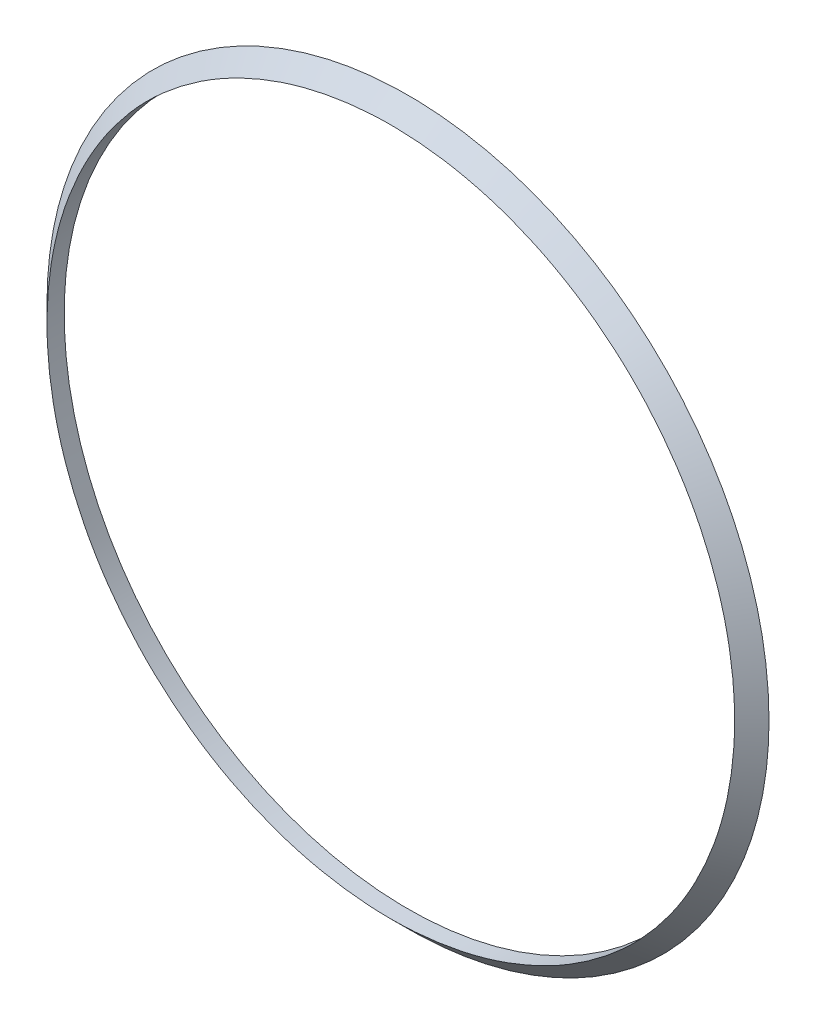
ISO-10303-21;
HEADER;
FILE_DESCRIPTION(('STEP AP214'),'2;1');
FILE_NAME('part.step','',(''),(''),'','','');
FILE_SCHEMA(('AUTOMOTIVE_DESIGN { 1 0 10303 214 1 1 1 1 }'));
ENDSEC;
DATA;
#1=APPLICATION_CONTEXT('core data for automotive mechanical design processes');
#2=APPLICATION_PROTOCOL_DEFINITION('international standard','automotive_design',2000,#1);
#3=PRODUCT_CONTEXT('',#1,'mechanical');
#4=PRODUCT('Part','Part','',(#3));
#5=PRODUCT_RELATED_PRODUCT_CATEGORY('part','',(#4));
#6=PRODUCT_DEFINITION_FORMATION('','',#4);
#7=PRODUCT_DEFINITION_CONTEXT('part definition',#1,'design');
#8=PRODUCT_DEFINITION('design','',#6,#7);
#9=PRODUCT_DEFINITION_SHAPE('','',#8);
#10=(LENGTH_UNIT() NAMED_UNIT(*) SI_UNIT(.MILLI.,.METRE.));
#11=(NAMED_UNIT(*) PLANE_ANGLE_UNIT() SI_UNIT($,.RADIAN.));
#12=(NAMED_UNIT(*) SI_UNIT($,.STERADIAN.) SOLID_ANGLE_UNIT());
#13=UNCERTAINTY_MEASURE_WITH_UNIT(LENGTH_MEASURE(1.E-05),#10,'distance_accuracy_value','');
#14=(GEOMETRIC_REPRESENTATION_CONTEXT(3) GLOBAL_UNCERTAINTY_ASSIGNED_CONTEXT((#13)) GLOBAL_UNIT_ASSIGNED_CONTEXT((#10,
#11,#12)) REPRESENTATION_CONTEXT('',''));
#15=CARTESIAN_POINT('',(0.,0.,0.));
#16=DIRECTION('',(0.,0.,1.));
#17=DIRECTION('',(1.,0.,0.));
#18=AXIS2_PLACEMENT_3D('',#15,#16,#17);
#19=CARTESIAN_POINT('',(0.,0.,51.));
#20=DIRECTION('',(0.,0.,-1.));
#21=DIRECTION('',(-1.,0.,0.));
#22=AXIS2_PLACEMENT_3D('',#19,#20,#21);
#23=CYLINDRICAL_SURFACE('',#22,60.);
#24=CARTESIAN_POINT('',(60.,0.,28.));
#25=CARTESIAN_POINT('',(59.9999956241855,-1.42315176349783,28.0000046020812));
#26=CARTESIAN_POINT('',(59.9493299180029,-2.84641943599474,27.9995584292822));
#27=CARTESIAN_POINT('',(59.7975386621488,-4.97612288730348,27.9992040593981));
#28=CARTESIAN_POINT('',(59.7342667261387,-5.68545603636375,27.9991384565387));
#29=CARTESIAN_POINT('',(59.5825098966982,-7.10152235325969,27.9991476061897));
#30=CARTESIAN_POINT('',(59.4940215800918,-7.80825515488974,27.999222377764));
#31=CARTESIAN_POINT('',(59.1890197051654,-9.93607125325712,27.9996203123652));
#32=CARTESIAN_POINT('',(58.9338907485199,-11.3517961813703,28.0001188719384));
#33=CARTESIAN_POINT('',(58.3225180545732,-14.1616237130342,28.0006307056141));
#34=CARTESIAN_POINT('',(57.9662487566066,-15.5557207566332,28.0006438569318));
#35=CARTESIAN_POINT('',(57.3572892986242,-17.6255442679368,28.0004745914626));
#36=CARTESIAN_POINT('',(57.1417093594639,-18.3123795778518,28.0003865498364));
#37=CARTESIAN_POINT('',(56.6859684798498,-19.6778791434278,28.0001929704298));
#38=CARTESIAN_POINT('',(56.4458075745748,-20.3565434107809,28.0000874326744));
#39=CARTESIAN_POINT('',(55.9412210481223,-21.704790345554,27.9999245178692));
#40=CARTESIAN_POINT('',(55.6767952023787,-22.3743729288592,27.9998671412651));
#41=CARTESIAN_POINT('',(55.1240182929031,-23.7036015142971,27.999874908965));
#42=CARTESIAN_POINT('',(54.8356667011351,-24.3632472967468,27.9999400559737));
#43=CARTESIAN_POINT('',(54.1839210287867,-25.7839831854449,28.0001257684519));
#44=CARTESIAN_POINT('',(53.8161390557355,-26.5430650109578,28.0002539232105));
#45=CARTESIAN_POINT('',(53.0489030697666,-28.0450543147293,28.0004669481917));
#46=CARTESIAN_POINT('',(52.6494486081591,-28.7879615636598,28.0005518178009));
#47=CARTESIAN_POINT('',(51.8195270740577,-30.2563702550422,28.0006160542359));
#48=CARTESIAN_POINT('',(51.3890561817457,-30.9818695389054,28.0005954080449));
#49=CARTESIAN_POINT('',(50.4979149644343,-32.4140696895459,28.0003986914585));
#50=CARTESIAN_POINT('',(50.0372448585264,-33.1207706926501,28.0002226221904));
#51=CARTESIAN_POINT('',(49.086463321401,-34.5142089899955,27.999795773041));
#52=CARTESIAN_POINT('',(48.596348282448,-35.2009438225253,27.9995449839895));
#53=CARTESIAN_POINT('',(47.5875970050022,-36.5531408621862,27.9992112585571));
#54=CARTESIAN_POINT('',(47.0689607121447,-37.2186030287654,27.9991283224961));
#55=CARTESIAN_POINT('',(46.0041140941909,-38.5270420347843,27.9991616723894));
#56=CARTESIAN_POINT('',(45.4579046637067,-39.1700196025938,27.999277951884));
#57=CARTESIAN_POINT('',(44.3388431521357,-40.4323929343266,27.9996009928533));
#58=CARTESIAN_POINT('',(43.7659910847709,-41.0517887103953,27.9998077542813));
#59=CARTESIAN_POINT('',(42.8875634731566,-41.9623020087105,27.9999756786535));
#60=CARTESIAN_POINT('',(42.5915622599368,-42.2627101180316,28.0000079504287));
#61=CARTESIAN_POINT('',(41.993292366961,-42.8572192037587,27.9999863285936));
#62=CARTESIAN_POINT('',(41.6910236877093,-43.1513201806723,27.9999324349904));
#63=CARTESIAN_POINT('',(40.7750215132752,-44.0239580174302,27.9997223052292));
#64=CARTESIAN_POINT('',(40.1520594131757,-44.5928634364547,27.9995176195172));
#65=CARTESIAN_POINT('',(38.8827189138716,-45.703890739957,27.9992225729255));
#66=CARTESIAN_POINT('',(38.2363403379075,-46.2460124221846,27.9991322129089));
#67=CARTESIAN_POINT('',(36.9213002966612,-47.3025260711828,27.9991559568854));
#68=CARTESIAN_POINT('',(36.2526388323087,-47.8169180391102,27.9992700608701));
#69=CARTESIAN_POINT('',(34.8942399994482,-48.8170388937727,27.9996429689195));
#70=CARTESIAN_POINT('',(34.2045034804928,-49.3027689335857,27.9999017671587));
#71=CARTESIAN_POINT('',(32.8052133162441,-50.2446964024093,28.0003106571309));
#72=CARTESIAN_POINT('',(32.0956596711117,-50.7008938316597,28.0004607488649));
#73=CARTESIAN_POINT('',(29.9391533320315,-52.0239406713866,28.0006823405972));
#74=CARTESIAN_POINT('',(28.4640498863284,-52.8454693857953,28.0005253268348));
#75=CARTESIAN_POINT('',(25.4498347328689,-54.3613076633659,28.000097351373));
#76=CARTESIAN_POINT('',(23.9107220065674,-55.0556152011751,27.9998263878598));
#77=CARTESIAN_POINT('',(21.5626798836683,-55.9978826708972,27.9999175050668));
#78=CARTESIAN_POINT('',(20.7733469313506,-56.2954671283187,28.0000308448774));
#79=CARTESIAN_POINT('',(19.1827891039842,-56.8571165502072,28.0002647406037));
#80=CARTESIAN_POINT('',(18.381564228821,-57.1211815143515,28.0003852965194));
#81=CARTESIAN_POINT('',(16.7687001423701,-57.6152944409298,28.0005556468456));
#82=CARTESIAN_POINT('',(15.9570608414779,-57.8453421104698,28.0006054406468));
#83=CARTESIAN_POINT('',(14.3248049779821,-58.2710159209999,28.0005847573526));
#84=CARTESIAN_POINT('',(13.50418844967,-58.466642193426,28.0005142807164));
#85=CARTESIAN_POINT('',(11.8554370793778,-58.8231245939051,28.0002083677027));
#86=CARTESIAN_POINT('',(11.0273022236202,-58.9839806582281,27.9999729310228));
#87=CARTESIAN_POINT('',(9.36498704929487,-59.2706367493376,27.9995337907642));
#88=CARTESIAN_POINT('',(8.53080673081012,-59.3964367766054,27.999330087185));
#89=CARTESIAN_POINT('',(6.85788651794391,-59.6127566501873,27.9991225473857));
#90=CARTESIAN_POINT('',(6.0191466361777,-59.7032765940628,27.9991187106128));
#91=CARTESIAN_POINT('',(4.33859636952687,-59.8488758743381,27.9992854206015));
#92=CARTESIAN_POINT('',(3.49678598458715,-59.9039552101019,27.9994559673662));
#93=CARTESIAN_POINT('',(1.81159155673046,-59.9785753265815,27.9998068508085));
#94=CARTESIAN_POINT('',(0.96820751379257,-59.9981161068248,27.9999871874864));
#95=CARTESIAN_POINT('',(-0.718634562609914,-60.001624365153,28.0000102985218));
#96=CARTESIAN_POINT('',(-1.56209259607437,-59.9855918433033,27.99985307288));
#97=CARTESIAN_POINT('',(-3.24758218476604,-59.9179820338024,27.9995123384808));
#98=CARTESIAN_POINT('',(-4.0896137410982,-59.8664047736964,27.9993288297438));
#99=CARTESIAN_POINT('',(-5.77075382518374,-59.7277972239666,27.9991293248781));
#100=CARTESIAN_POINT('',(-6.60986235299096,-59.6407669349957,27.9991133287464));
#101=CARTESIAN_POINT('',(-8.28361593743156,-59.4314141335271,27.9992840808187));
#102=CARTESIAN_POINT('',(-9.11826124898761,-59.3090936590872,27.9994708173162));
#103=CARTESIAN_POINT('',(-10.7817494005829,-59.0293598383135,27.9999038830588));
#104=CARTESIAN_POINT('',(-11.6105915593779,-58.8719424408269,28.0001502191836));
#105=CARTESIAN_POINT('',(-13.2608544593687,-58.5223128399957,28.0004816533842));
#106=CARTESIAN_POINT('',(-14.0822756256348,-58.3301026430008,28.0005667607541));
#107=CARTESIAN_POINT('',(-15.7162843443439,-57.9112231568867,28.0006125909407));
#108=CARTESIAN_POINT('',(-16.5288718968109,-57.6845538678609,28.0005733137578));
#109=CARTESIAN_POINT('',(-18.1437684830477,-57.1971592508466,28.0004166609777));
#110=CARTESIAN_POINT('',(-18.9460775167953,-56.9364339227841,28.0002992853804));
#111=CARTESIAN_POINT('',(-20.5389904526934,-56.3813908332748,28.000064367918));
#112=CARTESIAN_POINT('',(-21.3295943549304,-56.0870730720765,27.999946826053));
#113=CARTESIAN_POINT('',(-22.8976911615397,-55.4653684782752,27.9998549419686));
#114=CARTESIAN_POINT('',(-23.6751840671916,-55.1379816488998,27.9998805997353));
#115=CARTESIAN_POINT('',(-25.2156764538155,-54.4507210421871,28.0000343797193));
#116=CARTESIAN_POINT('',(-25.9786759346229,-54.0908472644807,28.0001625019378));
#117=CARTESIAN_POINT('',(-27.4888248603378,-53.3392526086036,28.0003932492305));
#118=CARTESIAN_POINT('',(-28.235974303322,-52.9475317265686,28.0004958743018));
#119=CARTESIAN_POINT('',(-29.7130942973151,-52.1329395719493,28.0006070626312));
#120=CARTESIAN_POINT('',(-30.4430648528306,-51.7100683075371,28.0006156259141));
#121=CARTESIAN_POINT('',(-31.8845295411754,-50.8339270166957,28.000493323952));
#122=CARTESIAN_POINT('',(-32.5960236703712,-50.3806569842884,28.0003624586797));
#123=CARTESIAN_POINT('',(-33.999269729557,-49.4445246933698,27.9999709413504));
#124=CARTESIAN_POINT('',(-34.6910216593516,-48.9616624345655,27.9997102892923));
#125=CARTESIAN_POINT('',(-36.0535551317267,-47.9672024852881,27.9993156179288));
#126=CARTESIAN_POINT('',(-36.7243366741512,-47.4556047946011,27.9991815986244));
#127=CARTESIAN_POINT('',(-38.0437299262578,-46.404590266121,27.9991194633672));
#128=CARTESIAN_POINT('',(-38.6923416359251,-45.865173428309,27.9991913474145));
#129=CARTESIAN_POINT('',(-39.9662668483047,-44.7594551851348,27.9994645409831));
#130=CARTESIAN_POINT('',(-40.5915803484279,-44.1931537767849,27.9996658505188));
#131=CARTESIAN_POINT('',(-41.5111903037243,-43.3243460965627,27.9998957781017));
#132=CARTESIAN_POINT('',(-41.8146750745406,-43.0315092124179,27.9999604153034));
#133=CARTESIAN_POINT('',(-42.41540365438,-42.4395024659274,28.0000099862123));
#134=CARTESIAN_POINT('',(-42.7126474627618,-42.140332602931,27.9999949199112));
#135=CARTESIAN_POINT('',(-43.5948107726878,-41.2335265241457,27.9998621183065));
#136=CARTESIAN_POINT('',(-44.1701962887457,-40.616561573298,27.9996567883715));
#137=CARTESIAN_POINT('',(-45.294426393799,-39.3589427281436,27.9993194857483));
#138=CARTESIAN_POINT('',(-45.843270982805,-38.7182888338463,27.9991875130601));
#139=CARTESIAN_POINT('',(-46.9134683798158,-37.4144065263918,27.9991176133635));
#140=CARTESIAN_POINT('',(-47.4348211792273,-36.7511781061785,27.9991796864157));
#141=CARTESIAN_POINT('',(-48.4491010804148,-35.4033328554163,27.9994833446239));
#142=CARTESIAN_POINT('',(-48.9420281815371,-34.7187160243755,27.999724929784));
#143=CARTESIAN_POINT('',(-49.8985819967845,-33.3293095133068,28.0001601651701));
#144=CARTESIAN_POINT('',(-50.362208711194,-32.6245198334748,28.0003538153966));
#145=CARTESIAN_POINT('',(-51.2593368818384,-31.1960213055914,28.0005803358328));
#146=CARTESIAN_POINT('',(-51.6928383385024,-30.4723124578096,28.0006132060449));
#147=CARTESIAN_POINT('',(-52.5289440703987,-29.0072644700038,28.0005698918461));
#148=CARTESIAN_POINT('',(-52.9315484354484,-28.2659253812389,28.0004937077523));
#149=CARTESIAN_POINT('',(-53.7051476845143,-26.7669288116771,28.0002892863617));
#150=CARTESIAN_POINT('',(-54.0761423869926,-26.0092712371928,28.000161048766));
#151=CARTESIAN_POINT('',(-54.7858590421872,-24.4789912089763,27.999950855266));
#152=CARTESIAN_POINT('',(-55.1245810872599,-23.7063687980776,27.9998688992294));
#153=CARTESIAN_POINT('',(-55.7691513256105,-22.1475308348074,27.9998726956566));
#154=CARTESIAN_POINT('',(-56.0749995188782,-21.3613152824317,27.9999584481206));
#155=CARTESIAN_POINT('',(-56.6532790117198,-19.7766868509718,28.0001719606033));
#156=CARTESIAN_POINT('',(-56.9257102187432,-18.9782739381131,28.0002997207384));
#157=CARTESIAN_POINT('',(-57.4366688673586,-17.3706772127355,28.0005010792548));
#158=CARTESIAN_POINT('',(-57.6751965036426,-16.5614934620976,28.0005746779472));
#159=CARTESIAN_POINT('',(-58.1179263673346,-14.9337870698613,28.0006116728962));
#160=CARTESIAN_POINT('',(-58.3221284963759,-14.1152644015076,28.000575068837));
#161=CARTESIAN_POINT('',(-58.6958434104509,-12.4703379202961,28.0003398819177));
#162=CARTESIAN_POINT('',(-58.8653561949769,-11.643934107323,28.0001412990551));
#163=CARTESIAN_POINT('',(-59.1693910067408,-9.9847147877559,27.9997041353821));
#164=CARTESIAN_POINT('',(-59.303913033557,-9.15189928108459,27.9994655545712));
#165=CARTESIAN_POINT('',(-59.5377271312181,-7.48133741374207,27.9991717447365));
#166=CARTESIAN_POINT('',(-59.6370192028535,-6.64359105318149,27.9991165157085));
#167=CARTESIAN_POINT('',(-59.8001968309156,-4.96465713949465,27.9991951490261));
#168=CARTESIAN_POINT('',(-59.8640823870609,-4.12346958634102,27.9993290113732));
#169=CARTESIAN_POINT('',(-59.9563333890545,-2.43914904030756,27.9996766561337));
#170=CARTESIAN_POINT('',(-59.9846988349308,-1.59601604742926,27.9998904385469));
#171=CARTESIAN_POINT('',(-60.0058591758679,0.0906960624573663,28.0000267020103));
#172=CARTESIAN_POINT('',(-59.998654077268,0.93427517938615,27.9999491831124));
#173=CARTESIAN_POINT('',(-59.9486861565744,2.620379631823,27.9996621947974));
#174=CARTESIAN_POINT('',(-59.9059233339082,3.46290496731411,27.9994527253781));
#175=CARTESIAN_POINT('',(-59.7849160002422,5.14540377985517,27.9991795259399));
#176=CARTESIAN_POINT('',(-59.7066714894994,5.9853772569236,27.9991157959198));
#177=CARTESIAN_POINT('',(-59.5148399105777,7.66127872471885,27.9991912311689));
#178=CARTESIAN_POINT('',(-59.4012528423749,8.49720671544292,27.9993303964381));
#179=CARTESIAN_POINT('',(-59.1389381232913,10.1635308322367,27.9997301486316));
#180=CARTESIAN_POINT('',(-58.9902104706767,10.9939269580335,27.9999907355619));
#181=CARTESIAN_POINT('',(-58.6578790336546,12.6477108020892,28.0003770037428));
#182=CARTESIAN_POINT('',(-58.4742752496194,13.4710985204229,28.0005026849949));
#183=CARTESIAN_POINT('',(-58.072518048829,15.1094013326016,28.0006165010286));
#184=CARTESIAN_POINT('',(-57.8543646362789,15.9243164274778,28.000604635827));
#185=CARTESIAN_POINT('',(-57.3838960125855,17.544225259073,28.0004883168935));
#186=CARTESIAN_POINT('',(-57.1315807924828,18.34921899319,28.0003838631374));
#187=CARTESIAN_POINT('',(-56.5932372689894,19.9478534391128,28.0001518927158));
#188=CARTESIAN_POINT('',(-56.3072089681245,20.741494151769,28.000024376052));
#189=CARTESIAN_POINT('',(-55.7019478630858,22.3160114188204,27.9998765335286));
#190=CARTESIAN_POINT('',(-55.38271505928,23.096887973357,27.9998562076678));
#191=CARTESIAN_POINT('',(-54.7116125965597,24.6444883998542,27.9999550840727));
#192=CARTESIAN_POINT('',(-54.3597429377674,25.4112122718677,28.0000742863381));
#193=CARTESIAN_POINT('',(-53.6239924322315,26.9291440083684,28.0003095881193));
#194=CARTESIAN_POINT('',(-53.2401115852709,27.6803518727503,28.0004256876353));
#195=CARTESIAN_POINT('',(-52.4410213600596,29.1659157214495,28.0005779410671));
#196=CARTESIAN_POINT('',(-52.0258119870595,29.9002717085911,28.0006140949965));
#197=CARTESIAN_POINT('',(-51.1648029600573,31.3508261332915,28.0005606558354));
#198=CARTESIAN_POINT('',(-50.7190033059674,32.0670245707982,28.0004710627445));
#199=CARTESIAN_POINT('',(-49.7975798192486,33.4800311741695,28.000132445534));
#200=CARTESIAN_POINT('',(-49.321954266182,34.1768382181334,27.9998834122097));
#201=CARTESIAN_POINT('',(-48.341804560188,35.5497005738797,27.9994529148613));
#202=CARTESIAN_POINT('',(-47.8372837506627,36.2257582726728,27.999271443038));
#203=CARTESIAN_POINT('',(-46.8001606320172,37.5560424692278,27.999111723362));
#204=CARTESIAN_POINT('',(-46.267556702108,38.210267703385,27.9991334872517));
#205=CARTESIAN_POINT('',(-45.175241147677,39.4956826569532,27.9993423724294));
#206=CARTESIAN_POINT('',(-44.6155295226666,40.1268723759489,27.9995294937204));
#207=CARTESIAN_POINT('',(-43.4699937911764,41.3650939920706,27.9998659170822));
#208=CARTESIAN_POINT('',(-42.8841696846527,41.9721258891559,28.000015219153));
#209=CARTESIAN_POINT('',(-41.6874506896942,43.1609524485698,27.9999784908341));
#210=CARTESIAN_POINT('',(-41.0765558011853,43.7427471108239,27.9997924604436));
#211=CARTESIAN_POINT('',(-39.8307811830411,44.8800649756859,27.9994398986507));
#212=CARTESIAN_POINT('',(-39.1959014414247,45.43558816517,27.9992733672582));
#213=CARTESIAN_POINT('',(-37.9032863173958,46.5193749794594,27.9991166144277));
#214=CARTESIAN_POINT('',(-37.2455509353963,47.0476386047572,27.9991263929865));
#215=CARTESIAN_POINT('',(-35.9083940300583,48.0759669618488,27.9993445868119));
#216=CARTESIAN_POINT('',(-35.2289725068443,48.5760316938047,27.9995530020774));
#217=CARTESIAN_POINT('',(-33.8496517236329,49.5470729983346,27.9999931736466));
#218=CARTESIAN_POINT('',(-33.1497524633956,50.018049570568,28.0002249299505));
#219=CARTESIAN_POINT('',(-31.730720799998,50.9300766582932,28.0005229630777));
#220=CARTESIAN_POINT('',(-31.0115884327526,51.3711272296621,28.00058924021));
#221=CARTESIAN_POINT('',(-29.5553698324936,52.2225191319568,28.0006027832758));
#222=CARTESIAN_POINT('',(-28.8182835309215,52.6328603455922,28.0005500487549));
#223=CARTESIAN_POINT('',(-27.3274547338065,53.422106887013,28.000375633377));
#224=CARTESIAN_POINT('',(-26.573712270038,53.801012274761,28.0002539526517));
#225=CARTESIAN_POINT('',(-25.0509736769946,54.5266933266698,28.0000217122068));
#226=CARTESIAN_POINT('',(-24.2819775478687,54.8734689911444,27.9999111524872));
#227=CARTESIAN_POINT('',(-21.9541501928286,55.8646462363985,27.9998291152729));
#228=CARTESIAN_POINT('',(-20.3741459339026,56.4600748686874,28.0001071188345));
#229=CARTESIAN_POINT('',(-17.1695795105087,57.5156623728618,28.0005350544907));
#230=CARTESIAN_POINT('',(-15.5450173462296,57.9758212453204,28.0006849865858));
#231=CARTESIAN_POINT('',(-13.0838329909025,58.5621494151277,28.0004494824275));
#232=CARTESIAN_POINT('',(-12.2592883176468,58.7402878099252,28.000294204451));
#233=CARTESIAN_POINT('',(-10.6033718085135,59.0616594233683,27.9998811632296));
#234=CARTESIAN_POINT('',(-9.77199997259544,59.2048926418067,27.9996233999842));
#235=CARTESIAN_POINT('',(-8.10396850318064,59.4561782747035,27.9992575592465));
#236=CARTESIAN_POINT('',(-7.26730886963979,59.5642306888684,27.9991494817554));
#237=CARTESIAN_POINT('',(-5.59018184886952,59.7449681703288,27.9991370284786));
#238=CARTESIAN_POINT('',(-4.74971446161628,59.8176532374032,27.9992326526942));
#239=CARTESIAN_POINT('',(-3.06643539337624,59.9275253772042,27.9995336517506));
#240=CARTESIAN_POINT('',(-2.22362371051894,59.9647124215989,27.9997390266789));
#241=CARTESIAN_POINT('',(-0.958845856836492,59.9938205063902,27.9999421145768));
#242=CARTESIAN_POINT('',(-0.537148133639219,59.9990775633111,27.99999231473));
#243=CARTESIAN_POINT('',(0.306264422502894,60.000700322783,28.0000055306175));
#244=CARTESIAN_POINT('',(0.727979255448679,59.9970660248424,27.999968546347));
#245=CARTESIAN_POINT('',(1.99285983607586,59.9728250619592,27.9997912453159));
#246=CARTESIAN_POINT('',(2.83580858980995,59.9388814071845,27.9995845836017));
#247=CARTESIAN_POINT('',(4.51949808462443,59.8354875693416,27.9992664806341));
#248=CARTESIAN_POINT('',(5.3602388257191,59.7660373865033,27.9991550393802));
#249=CARTESIAN_POINT('',(7.03804828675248,59.5917544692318,27.999132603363));
#250=CARTESIAN_POINT('',(7.87511702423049,59.4869219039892,27.9992216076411));
#251=CARTESIAN_POINT('',(9.54408871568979,59.242060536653,27.9995635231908));
#252=CARTESIAN_POINT('',(10.3759916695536,59.1020317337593,27.999816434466));
#253=CARTESIAN_POINT('',(12.0331551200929,58.7870268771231,28.0002402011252));
#254=CARTESIAN_POINT('',(12.8584156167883,58.6120508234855,28.0004110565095));
#255=CARTESIAN_POINT('',(14.5008260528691,58.2274625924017,28.0005989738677));
#256=CARTESIAN_POINT('',(15.3179759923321,58.0178504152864,28.0006160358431));
#257=CARTESIAN_POINT('',(16.9427200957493,57.5643605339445,28.000546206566));
#258=CARTESIAN_POINT('',(17.7503141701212,57.320482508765,28.0004593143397));
#259=CARTESIAN_POINT('',(19.3545026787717,56.7988960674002,28.0002428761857));
#260=CARTESIAN_POINT('',(20.1510971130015,56.5211876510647,28.0001133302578));
#261=CARTESIAN_POINT('',(21.731869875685,55.9324342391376,27.9999205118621));
#262=CARTESIAN_POINT('',(22.5160482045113,55.6213892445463,27.9998572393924));
#263=CARTESIAN_POINT('',(24.0705943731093,54.9665157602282,27.9998941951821));
#264=CARTESIAN_POINT('',(24.8409622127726,54.6226872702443,27.9999944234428));
#265=CARTESIAN_POINT('',(26.3665431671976,53.9028460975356,28.00021960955));
#266=CARTESIAN_POINT('',(27.1217557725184,53.5268323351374,28.0003445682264));
#267=CARTESIAN_POINT('',(28.615656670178,52.743299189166,28.0005311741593));
#268=CARTESIAN_POINT('',(29.3543449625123,52.3357798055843,28.0005928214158));
#269=CARTESIAN_POINT('',(30.8138839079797,51.4899599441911,28.0006009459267));
#270=CARTESIAN_POINT('',(31.5347345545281,51.0516594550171,28.0005474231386));
#271=CARTESIAN_POINT('',(32.9573160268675,50.1450569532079,28.0002748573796));
#272=CARTESIAN_POINT('',(33.6590468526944,49.6767549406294,28.0000558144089));
#273=CARTESIAN_POINT('',(35.0420881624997,48.711018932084,27.999614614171));
#274=CARTESIAN_POINT('',(35.723400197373,48.2135871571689,27.9993924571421));
#275=CARTESIAN_POINT('',(37.064448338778,47.1904437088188,27.9991417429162));
#276=CARTESIAN_POINT('',(37.7241844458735,46.664732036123,27.9991131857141));
#277=CARTESIAN_POINT('',(39.0209064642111,45.5859645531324,27.9992380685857));
#278=CARTESIAN_POINT('',(39.657892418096,45.0329087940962,27.9993915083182));
#279=CARTESIAN_POINT('',(40.9079828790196,43.9004355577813,27.9997456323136));
#280=CARTESIAN_POINT('',(41.5210873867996,43.3210180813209,27.9999463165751));
#281=CARTESIAN_POINT('',(42.7222226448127,42.1369523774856,28.0000252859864));
#282=CARTESIAN_POINT('',(43.310257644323,41.5323084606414,27.9999036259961));
#283=CARTESIAN_POINT('',(44.4603194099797,40.2987724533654,27.999584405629));
#284=CARTESIAN_POINT('',(45.0223461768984,39.6698803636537,27.9993868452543));
#285=CARTESIAN_POINT('',(46.1193966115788,38.3889610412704,27.9991496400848));
#286=CARTESIAN_POINT('',(46.6544200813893,37.7369336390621,27.9991099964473));
#287=CARTESIAN_POINT('',(47.6965085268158,36.4109069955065,27.9992345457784));
#288=CARTESIAN_POINT('',(48.2035735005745,35.7369077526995,27.9993987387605));
#289=CARTESIAN_POINT('',(49.1890519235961,34.367846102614,27.9998187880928));
#290=CARTESIAN_POINT('',(49.6674531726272,33.6727749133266,28.0000746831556));
#291=CARTESIAN_POINT('',(50.5945205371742,32.263077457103,28.0004347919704));
#292=CARTESIAN_POINT('',(51.0431866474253,31.5484511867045,28.0005390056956));
#293=CARTESIAN_POINT('',(51.9099725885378,30.1009365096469,28.0006170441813));
#294=CARTESIAN_POINT('',(52.3280933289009,29.3680486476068,28.0005908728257));
#295=CARTESIAN_POINT('',(53.1330596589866,27.8852937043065,28.0004529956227));
#296=CARTESIAN_POINT('',(53.5199052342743,27.1354266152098,28.0003412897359));
#297=CARTESIAN_POINT('',(54.2618777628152,25.6195471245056,28.0001059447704));
#298=CARTESIAN_POINT('',(54.6169836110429,24.8535243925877,27.9999822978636));
#299=CARTESIAN_POINT('',(55.2945579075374,23.3071757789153,27.9998622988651));
#300=CARTESIAN_POINT('',(55.6170262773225,22.526849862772,27.9998659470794));
#301=CARTESIAN_POINT('',(56.228788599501,20.9531880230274,27.9999947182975));
#302=CARTESIAN_POINT('',(56.5180783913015,20.159850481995,28.0001198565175));
#303=CARTESIAN_POINT('',(57.0629191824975,18.5616808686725,28.0003546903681));
#304=CARTESIAN_POINT('',(57.318470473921,17.7568488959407,28.0004643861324));
#305=CARTESIAN_POINT('',(57.7949901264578,16.1384485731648,28.000595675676));
#306=CARTESIAN_POINT('',(58.0160145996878,15.3248967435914,28.0006174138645));
#307=CARTESIAN_POINT('',(58.4235919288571,13.6892038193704,28.0005286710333));
#308=CARTESIAN_POINT('',(58.6101448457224,12.8670627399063,28.0004181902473));
#309=CARTESIAN_POINT('',(58.9483769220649,11.2160010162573,28.0000501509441));
#310=CARTESIAN_POINT('',(59.1000706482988,10.3870833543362,27.9997926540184));
#311=CARTESIAN_POINT('',(59.368400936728,8.72367906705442,27.9993782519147));
#312=CARTESIAN_POINT('',(59.4850416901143,7.88919311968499,27.9992213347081));
#313=CARTESIAN_POINT('',(59.6533352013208,6.46737819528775,27.9991273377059));
#314=CARTESIAN_POINT('',(59.7139848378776,5.88109915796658,27.9991383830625));
#315=CARTESIAN_POINT('',(59.8179759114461,4.70711879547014,27.9992439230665));
#316=CARTESIAN_POINT('',(59.8613204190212,4.11941774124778,27.9993384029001));
#317=CARTESIAN_POINT('',(59.9653065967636,2.35557567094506,27.9996836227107));
#318=CARTESIAN_POINT('',(60.0000036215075,1.1778275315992,27.9999961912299));
#319=CARTESIAN_POINT('',(60.,0.,28.));
#320=B_SPLINE_CURVE_WITH_KNOTS('',3,(#24,#25,#26,#27,#28,#29,#30,#31,#32,#33,#34,#35,#36,#37,
#38,#39,#40,#41,#42,#43,#44,#45,#46,#47,#48,#49,#50,#51,#52,#53,#54,#55,#56,#57,#58,#59,#60,#61,
#62,#63,#64,#65,#66,#67,#68,#69,#70,#71,#72,#73,#74,#75,#76,#77,#78,#79,#80,#81,#82,#83,#84,#85,
#86,#87,#88,#89,#90,#91,#92,#93,#94,#95,#96,#97,#98,#99,#100,#101,#102,#103,#104,#105,#106,#107,
#108,#109,#110,#111,#112,#113,#114,#115,#116,#117,#118,#119,#120,#121,#122,#123,#124,#125,#126,
#127,#128,#129,#130,#131,#132,#133,#134,#135,#136,#137,#138,#139,#140,#141,#142,#143,#144,#145,
#146,#147,#148,#149,#150,#151,#152,#153,#154,#155,#156,#157,#158,#159,#160,#161,#162,#163,#164,
#165,#166,#167,#168,#169,#170,#171,#172,#173,#174,#175,#176,#177,#178,#179,#180,#181,#182,#183,
#184,#185,#186,#187,#188,#189,#190,#191,#192,#193,#194,#195,#196,#197,#198,#199,#200,#201,#202,
#203,#204,#205,#206,#207,#208,#209,#210,#211,#212,#213,#214,#215,#216,#217,#218,#219,#220,#221,
#222,#223,#224,#225,#226,#227,#228,#229,#230,#231,#232,#233,#234,#235,#236,#237,#238,#239,#240,
#241,#242,#243,#244,#245,#246,#247,#248,#249,#250,#251,#252,#253,#254,#255,#256,#257,#258,#259,
#260,#261,#262,#263,#264,#265,#266,#267,#268,#269,#270,#271,#272,#273,#274,#275,#276,#277,#278,
#279,#280,#281,#282,#283,#284,#285,#286,#287,#288,#289,#290,#291,#292,#293,#294,#295,#296,#297,
#298,#299,#300,#301,#302,#303,#304,#305,#306,#307,#308,#309,#310,#311,#312,#313,#314,#315,#316,
#317,#318,#319),.UNSPECIFIED.,.T.,.F.,(4,2,2,2,2,2,2,2,2,2,2,2,2,2,2,2,2,2,2,2,2,2,2,2,2,2,2,2,
2,2,2,2,2,2,2,2,2,2,2,2,2,2,2,2,2,2,2,2,2,2,2,2,2,2,2,2,2,2,2,2,2,2,2,2,2,2,2,2,2,2,2,2,2,2,2,2,
2,2,2,2,2,2,2,2,2,2,2,2,2,2,2,2,2,2,2,2,2,2,2,2,2,2,2,2,2,2,2,2,2,2,2,2,2,2,2,2,2,2,2,2,2,2,2,2,
2,2,2,2,2,2,2,2,2,2,2,2,2,2,2,2,2,2,2,2,2,2,2,4),(0.,4.26852315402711,6.40458894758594,
8.54094485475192,12.8525916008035,17.1653289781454,19.3245597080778,21.4837873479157,
23.6430349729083,25.8023302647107,28.3320193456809,30.8617442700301,33.391781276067,
35.9217999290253,38.4521292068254,40.9824633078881,43.5127153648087,46.0429661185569,
47.3080950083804,48.5732237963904,51.103341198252,53.6334777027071,56.1636141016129,
58.6936486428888,61.2236831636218,66.2826184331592,71.3416342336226,73.8717055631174,
76.401776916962,78.9318700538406,81.4619535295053,83.9920416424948,86.5221297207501,
89.0522108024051,91.5822919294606,94.112373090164,96.6424542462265,99.172533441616,
101.702612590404,104.232545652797,106.762770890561,109.292850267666,111.822929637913,
114.353009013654,116.883088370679,119.413167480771,121.943246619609,124.473326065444,
127.003404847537,129.533484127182,132.063563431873,134.593642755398,137.123722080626,
139.653801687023,140.918911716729,142.184021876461,144.714101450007,147.244181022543,
149.774261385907,152.304341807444,154.834422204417,157.364502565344,159.894575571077,
162.424663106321,164.95474340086,167.484823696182,170.014910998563,172.544983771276,
175.075063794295,177.605143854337,180.135223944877,182.665303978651,185.195384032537,
187.725464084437,190.255543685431,192.785623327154,195.315702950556,197.845782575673,
200.375862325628,202.905942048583,205.436021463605,207.966101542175,210.4961814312,
213.026261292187,215.55634114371,218.08642101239,220.616500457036,223.146579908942,
225.676805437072,228.206738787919,230.736818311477,233.266897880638,235.796977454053,
238.327057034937,240.857137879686,243.387218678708,245.917299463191,248.447380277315,
250.977456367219,253.507542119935,256.037623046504,258.56770394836,263.62673550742,
268.685767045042,271.215845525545,273.745924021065,276.276002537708,278.806081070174,
281.336161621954,282.601272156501,283.866382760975,286.39646327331,288.926543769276,
291.456612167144,293.986680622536,296.516749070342,299.046817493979,301.576909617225,
304.107001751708,306.637093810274,309.16718588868,311.697362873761,314.227539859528,
316.75771777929,319.287895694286,321.817880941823,324.347866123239,326.877846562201,
329.40782692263,331.937376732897,334.466926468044,336.996494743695,339.526063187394,
342.056700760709,344.587338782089,347.117901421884,349.648465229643,352.180699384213,
354.71293962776,357.245497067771,359.778032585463,362.306408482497,364.834779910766,
367.362092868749,369.889103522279,371.657082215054,373.424747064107,376.957458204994),.UNSPECIFIED.);
#321=CARTESIAN_POINT('',(60.,0.,28.));
#322=VERTEX_POINT('',#321);
#323=EDGE_CURVE('E37',#322,#322,#320,.T.);
#324=ORIENTED_EDGE('',*,*,#323,.F.);
#325=EDGE_LOOP('',(#324));
#326=FACE_BOUND('',#325,.T.);
#327=CARTESIAN_POINT('',(0.,0.,25.));
#328=DIRECTION('',(0.,0.,1.));
#329=DIRECTION('',(1.,0.,0.));
#330=AXIS2_PLACEMENT_3D('',#327,#328,#329);
#331=CIRCLE('',#330,60.);
#332=CARTESIAN_POINT('',(60.,0.,25.));
#333=VERTEX_POINT('',#332);
#334=EDGE_CURVE('E47',#333,#333,#331,.T.);
#335=ORIENTED_EDGE('',*,*,#334,.F.);
#336=EDGE_LOOP('',(#335));
#337=FACE_BOUND('',#336,.T.);
#338=ADVANCED_FACE('F30',(#326,#337),#23,.F.);
#339=CARTESIAN_POINT('',(0.,0.,25.));
#340=DIRECTION('',(0.,0.,1.));
#341=DIRECTION('',(1.,0.,0.));
#342=AXIS2_PLACEMENT_3D('',#339,#340,#341);
#343=PLANE('',#342);
#344=CARTESIAN_POINT('',(63.,0.,25.));
#345=CARTESIAN_POINT('',(63.0000001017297,0.711238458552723,25.));
#346=CARTESIAN_POINT('',(62.9878384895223,1.42246824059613,25.));
#347=CARTESIAN_POINT('',(62.9393941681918,2.84410947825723,25.));
#348=CARTESIAN_POINT('',(62.9031113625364,3.5545209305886,25.));
#349=CARTESIAN_POINT('',(62.8065401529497,4.97442093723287,25.));
#350=CARTESIAN_POINT('',(62.7462280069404,5.68390788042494,25.));
#351=CARTESIAN_POINT('',(62.6017113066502,7.10053888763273,25.));
#352=CARTESIAN_POINT('',(62.5175028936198,7.80768255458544,25.));
#353=CARTESIAN_POINT('',(62.2622525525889,9.6814732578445,25.));
#354=CARTESIAN_POINT('',(62.0704796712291,10.8453655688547,25.));
#355=CARTESIAN_POINT('',(61.6216401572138,13.161007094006,25.));
#356=CARTESIAN_POINT('',(61.3645432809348,14.3127504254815,25.));
#357=CARTESIAN_POINT('',(60.7858018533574,16.600060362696,25.));
#358=CARTESIAN_POINT('',(60.464148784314,17.7356248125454,25.));
#359=CARTESIAN_POINT('',(59.7569717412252,19.9884760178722,25.));
#360=CARTESIAN_POINT('',(59.3713601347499,21.1057353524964,25.));
#361=CARTESIAN_POINT('',(58.7464469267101,22.7638899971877,25.));
#362=CARTESIAN_POINT('',(58.5303944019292,23.3136498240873,25.));
#363=CARTESIAN_POINT('',(58.082989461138,24.4069080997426,25.));
#364=CARTESIAN_POINT('',(57.8516369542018,24.9504065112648,25.));
#365=CARTESIAN_POINT('',(57.1348667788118,26.5707899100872,25.));
#366=CARTESIAN_POINT('',(56.6266742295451,27.6377281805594,25.));
#367=CARTESIAN_POINT('',(55.6856713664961,29.4780109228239,25.));
#368=CARTESIAN_POINT('',(55.2658086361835,30.2580284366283,25.));
#369=CARTESIAN_POINT('',(54.3934746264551,31.7996161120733,25.));
#370=CARTESIAN_POINT('',(53.9410044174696,32.5611868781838,25.));
#371=CARTESIAN_POINT('',(53.0041984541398,34.0645186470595,25.));
#372=CARTESIAN_POINT('',(52.519860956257,34.8062785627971,25.));
#373=CARTESIAN_POINT('',(51.5202876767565,36.2686653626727,25.));
#374=CARTESIAN_POINT('',(51.0050522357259,36.9892924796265,25.));
#375=CARTESIAN_POINT('',(49.9449792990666,38.4080457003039,25.));
#376=CARTESIAN_POINT('',(49.4001520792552,39.1061794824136,25.));
#377=CARTESIAN_POINT('',(48.2817185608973,40.4789953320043,25.));
#378=CARTESIAN_POINT('',(47.7081121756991,41.1536773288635,25.));
#379=CARTESIAN_POINT('',(46.5330209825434,42.4783466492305,25.));
#380=CARTESIAN_POINT('',(45.9315363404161,43.1283341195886,25.));
#381=CARTESIAN_POINT('',(45.0090969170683,44.0837199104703,25.));
#382=CARTESIAN_POINT('',(44.6982409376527,44.3989230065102,25.));
#383=CARTESIAN_POINT('',(44.0698920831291,45.0226433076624,25.));
#384=CARTESIAN_POINT('',(43.7523991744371,45.3311604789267,25.));
#385=CARTESIAN_POINT('',(42.7906846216,46.2461055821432,25.));
#386=CARTESIAN_POINT('',(42.1367612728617,46.8424094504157,25.));
#387=CARTESIAN_POINT('',(40.8045405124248,48.0069686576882,25.));
#388=CARTESIAN_POINT('',(40.1262428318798,48.575223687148,25.));
#389=CARTESIAN_POINT('',(38.0564836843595,50.2366929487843,25.));
#390=CARTESIAN_POINT('',(36.6298653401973,51.2868877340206,25.));
#391=CARTESIAN_POINT('',(34.4279035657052,52.7687770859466,25.));
#392=CARTESIAN_POINT('',(33.6834711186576,53.2472321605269,25.));
#393=CARTESIAN_POINT('',(32.1749645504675,54.172273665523,25.));
#394=CARTESIAN_POINT('',(31.4108903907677,54.618860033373,25.));
#395=CARTESIAN_POINT('',(29.8645772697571,55.4793525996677,25.));
#396=CARTESIAN_POINT('',(29.0823382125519,55.8932586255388,25.));
#397=CARTESIAN_POINT('',(27.501099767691,56.6877269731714,25.));
#398=CARTESIAN_POINT('',(26.7021003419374,57.0682892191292,25.));
#399=CARTESIAN_POINT('',(25.0879359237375,57.7959019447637,25.));
#400=CARTESIAN_POINT('',(24.2727541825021,58.1429152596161,25.));
#401=CARTESIAN_POINT('',(22.6285392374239,58.8024106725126,25.));
#402=CARTESIAN_POINT('',(21.7995060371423,59.1148927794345,25.));
#403=CARTESIAN_POINT('',(20.1290094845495,59.7046288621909,25.));
#404=CARTESIAN_POINT('',(19.2875462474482,59.981883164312,25.));
#405=CARTESIAN_POINT('',(17.5936570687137,60.5005908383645,25.));
#406=CARTESIAN_POINT('',(16.7412311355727,60.7420442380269,25.));
#407=CARTESIAN_POINT('',(15.0269084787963,61.1886743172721,25.));
#408=CARTESIAN_POINT('',(14.1650115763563,61.3938503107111,25.));
#409=CARTESIAN_POINT('',(12.4333041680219,61.767505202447,25.));
#410=CARTESIAN_POINT('',(11.5634936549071,61.9359840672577,25.));
#411=CARTESIAN_POINT('',(9.81753211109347,62.236150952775,25.));
#412=CARTESIAN_POINT('',(8.94138105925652,62.367838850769,25.));
#413=CARTESIAN_POINT('',(7.18438141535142,62.5943529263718,25.));
#414=CARTESIAN_POINT('',(6.30353279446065,62.6891788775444,25.));
#415=CARTESIAN_POINT('',(3.6555239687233,62.9181637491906,25.));
#416=CARTESIAN_POINT('',(1.88322899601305,62.9967733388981,25.));
#417=CARTESIAN_POINT('',(-1.66162969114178,63.0030299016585,25.));
#418=CARTESIAN_POINT('',(-3.43419340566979,62.9306768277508,25.));
#419=CARTESIAN_POINT('',(-6.08333294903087,62.7109485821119,25.));
#420=CARTESIAN_POINT('',(-6.96485005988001,62.6191578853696,25.));
#421=CARTESIAN_POINT('',(-8.72331257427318,62.3986760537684,25.));
#422=CARTESIAN_POINT('',(-9.60025800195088,62.2699851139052,25.));
#423=CARTESIAN_POINT('',(-11.3479349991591,61.9757847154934,25.));
#424=CARTESIAN_POINT('',(-12.2186665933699,61.8102754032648,25.));
#425=CARTESIAN_POINT('',(-13.9523382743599,61.4425072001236,25.));
#426=CARTESIAN_POINT('',(-14.8152783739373,61.240248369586,25.));
#427=CARTESIAN_POINT('',(-16.5311126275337,60.7995658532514,25.));
#428=CARTESIAN_POINT('',(-17.3840144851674,60.5611721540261,25.));
#429=CARTESIAN_POINT('',(-19.0789874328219,60.0485705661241,25.));
#430=CARTESIAN_POINT('',(-19.921058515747,59.774362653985,25.));
#431=CARTESIAN_POINT('',(-21.5929015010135,59.1906967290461,25.));
#432=CARTESIAN_POINT('',(-22.4226732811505,58.8812383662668,25.));
#433=CARTESIAN_POINT('',(-24.0684940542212,58.2277622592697,25.));
#434=CARTESIAN_POINT('',(-24.8845430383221,57.8837444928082,25.));
#435=CARTESIAN_POINT('',(-26.5014692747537,57.1617100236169,25.));
#436=CARTESIAN_POINT('',(-27.3023464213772,56.7836930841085,25.));
#437=CARTESIAN_POINT('',(-28.887437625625,55.9942173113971,25.));
#438=CARTESIAN_POINT('',(-29.6716517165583,55.5827585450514,25.));
#439=CARTESIAN_POINT('',(-31.2220052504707,54.7270563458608,25.));
#440=CARTESIAN_POINT('',(-31.9881447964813,54.2828130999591,25.));
#441=CARTESIAN_POINT('',(-33.500868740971,53.3623520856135,25.));
#442=CARTESIAN_POINT('',(-34.2474531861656,52.8861343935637,25.));
#443=CARTESIAN_POINT('',(-36.4551422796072,51.4113153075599,25.));
#444=CARTESIAN_POINT('',(-37.8854832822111,50.3658297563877,25.));
#445=CARTESIAN_POINT('',(-39.9610963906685,48.7111632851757,25.));
#446=CARTESIAN_POINT('',(-40.6413907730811,48.1451324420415,25.));
#447=CARTESIAN_POINT('',(-41.9777035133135,46.9849425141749,25.));
#448=CARTESIAN_POINT('',(-42.6337221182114,46.3907837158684,25.));
#449=CARTESIAN_POINT('',(-43.5984411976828,45.4792071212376,25.));
#450=CARTESIAN_POINT('',(-43.9168085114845,45.1719457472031,25.));
#451=CARTESIAN_POINT('',(-44.5469404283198,44.5507258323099,25.));
#452=CARTESIAN_POINT('',(-44.85870506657,44.2367673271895,25.));
#453=CARTESIAN_POINT('',(-45.7839036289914,43.2850831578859,25.));
#454=CARTESIAN_POINT('',(-46.3872734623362,42.637519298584,25.));
#455=CARTESIAN_POINT('',(-47.5662353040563,41.3176239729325,25.));
#456=CARTESIAN_POINT('',(-48.1418273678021,40.6452925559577,25.));
#457=CARTESIAN_POINT('',(-49.2643432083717,39.277102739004,25.));
#458=CARTESIAN_POINT('',(-49.8112669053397,38.5812442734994,25.));
#459=CARTESIAN_POINT('',(-50.8766023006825,37.1657032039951,25.));
#460=CARTESIAN_POINT('',(-51.3949511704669,36.4459732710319,25.));
#461=CARTESIAN_POINT('',(-52.4007335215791,34.9853014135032,25.));
#462=CARTESIAN_POINT('',(-52.888167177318,34.2443596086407,25.));
#463=CARTESIAN_POINT('',(-54.302621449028,31.9915585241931,25.));
#464=CARTESIAN_POINT('',(-55.1820354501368,30.4494047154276,25.));
#465=CARTESIAN_POINT('',(-56.8072870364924,27.2965690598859,25.));
#466=CARTESIAN_POINT('',(-57.5531273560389,25.6858886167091,25.));
#467=CARTESIAN_POINT('',(-58.9069444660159,22.4075969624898,25.));
#468=CARTESIAN_POINT('',(-59.514921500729,20.7399858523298,25.));
#469=CARTESIAN_POINT('',(-60.5870588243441,17.3615663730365,25.));
#470=CARTESIAN_POINT('',(-61.0514271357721,15.6508244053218,25.));
#471=CARTESIAN_POINT('',(-61.6381127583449,13.0603242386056,25.));
#472=CARTESIAN_POINT('',(-61.8153772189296,12.1926608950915,25.));
#473=CARTESIAN_POINT('',(-62.1331554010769,10.45056652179,25.));
#474=CARTESIAN_POINT('',(-62.2736688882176,9.57613544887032,25.));
#475=CARTESIAN_POINT('',(-62.5178998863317,7.82216666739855,25.));
#476=CARTESIAN_POINT('',(-62.6216173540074,6.94262895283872,25.));
#477=CARTESIAN_POINT('',(-62.7920841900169,5.17997621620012,25.));
#478=CARTESIAN_POINT('',(-62.8588336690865,4.29686120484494,25.));
#479=CARTESIAN_POINT('',(-62.9551293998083,2.52859865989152,25.));
#480=CARTESIAN_POINT('',(-62.9846755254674,1.64345111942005,25.));
#481=CARTESIAN_POINT('',(-63.0061217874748,-0.127298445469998,25.));
#482=CARTESIAN_POINT('',(-62.9980220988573,-1.01290046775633,25.));
#483=CARTESIAN_POINT('',(-62.9443890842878,-2.78226843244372,25.));
#484=CARTESIAN_POINT('',(-62.8988851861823,-3.66603527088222,25.));
#485=CARTESIAN_POINT('',(-62.7708476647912,-5.4308886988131,25.));
#486=CARTESIAN_POINT('',(-62.688313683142,-6.31197526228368,25.));
#487=CARTESIAN_POINT('',(-62.4864256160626,-8.06986380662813,25.));
#488=CARTESIAN_POINT('',(-62.3670738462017,-8.94666605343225,25.));
#489=CARTESIAN_POINT('',(-62.0916560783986,-10.6945878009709,25.));
#490=CARTESIAN_POINT('',(-61.9355860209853,-11.5657066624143,25.));
#491=CARTESIAN_POINT('',(-61.5867536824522,-13.3005638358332,25.));
#492=CARTESIAN_POINT('',(-61.39399160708,-14.164302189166,25.));
#493=CARTESIAN_POINT('',(-60.9721432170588,-15.8827581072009,25.));
#494=CARTESIAN_POINT('',(-60.7430610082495,-16.737476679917,25.));
#495=CARTESIAN_POINT('',(-60.2489951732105,-18.436533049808,25.));
#496=CARTESIAN_POINT('',(-59.9840092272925,-19.2808701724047,25.));
#497=CARTESIAN_POINT('',(-59.4186883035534,-20.957626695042,25.));
#498=CARTESIAN_POINT('',(-59.1183532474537,-21.790046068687,25.));
#499=CARTESIAN_POINT('',(-58.4825964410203,-23.4425732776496,25.));
#500=CARTESIAN_POINT('',(-58.147131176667,-24.2626643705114,25.));
#501=CARTESIAN_POINT('',(-57.4420472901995,-25.8880315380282,25.));
#502=CARTESIAN_POINT('',(-57.0724286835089,-26.6933076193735,25.));
#503=CARTESIAN_POINT('',(-56.2995604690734,-28.2875485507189,25.));
#504=CARTESIAN_POINT('',(-55.8963111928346,-29.0765135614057,25.));
#505=CARTESIAN_POINT('',(-55.0568273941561,-30.6366946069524,25.));
#506=CARTESIAN_POINT('',(-54.6205928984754,-31.4079106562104,25.));
#507=CARTESIAN_POINT('',(-53.7158644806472,-32.9312111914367,25.));
#508=CARTESIAN_POINT('',(-53.2473697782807,-33.6832952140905,25.));
#509=CARTESIAN_POINT('',(-52.2789470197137,-35.1669383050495,25.));
#510=CARTESIAN_POINT('',(-51.7790189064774,-35.8984973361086,25.));
#511=CARTESIAN_POINT('',(-50.7487985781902,-37.3399416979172,25.));
#512=CARTESIAN_POINT('',(-50.2185062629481,-38.0498269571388,25.));
#513=CARTESIAN_POINT('',(-49.1286794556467,-39.4466768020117,25.));
#514=CARTESIAN_POINT('',(-48.5691448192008,-40.133641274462,25.));
#515=CARTESIAN_POINT('',(-46.8475430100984,-42.1589201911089,25.));
#516=CARTESIAN_POINT('',(-45.6426070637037,-43.4614395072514,25.));
#517=CARTESIAN_POINT('',(-43.7559380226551,-45.3343215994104,25.));
#518=CARTESIAN_POINT('',(-43.1137633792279,-45.945194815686,25.));
#519=CARTESIAN_POINT('',(-41.8041682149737,-47.1393869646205,25.));
#520=CARTESIAN_POINT('',(-41.136747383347,-47.7227055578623,25.));
#521=CARTESIAN_POINT('',(-39.7780413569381,-48.8607806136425,25.));
#522=CARTESIAN_POINT('',(-39.0867567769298,-49.4155378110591,25.));
#523=CARTESIAN_POINT('',(-37.6815227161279,-50.4955648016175,25.));
#524=CARTESIAN_POINT('',(-36.9675733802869,-51.0208347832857,25.));
#525=CARTESIAN_POINT('',(-35.5181643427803,-52.0408050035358,25.));
#526=CARTESIAN_POINT('',(-34.7827047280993,-52.5355053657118,25.));
#527=CARTESIAN_POINT('',(-33.2914795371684,-53.493292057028,25.));
#528=CARTESIAN_POINT('',(-32.5357139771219,-53.9563784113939,25.));
#529=CARTESIAN_POINT('',(-31.0060217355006,-54.8497031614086,25.));
#530=CARTESIAN_POINT('',(-30.2321138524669,-55.2799737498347,25.));
#531=CARTESIAN_POINT('',(-28.6668199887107,-56.107453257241,25.));
#532=CARTESIAN_POINT('',(-27.8754339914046,-56.5046621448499,25.));
#533=CARTESIAN_POINT('',(-26.2766266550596,-57.2653920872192,25.));
#534=CARTESIAN_POINT('',(-25.4692051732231,-57.6289128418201,25.));
#535=CARTESIAN_POINT('',(-23.8398211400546,-58.3217569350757,25.));
#536=CARTESIAN_POINT('',(-23.0178585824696,-58.6510802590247,25.));
#537=CARTESIAN_POINT('',(-21.3608050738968,-59.2748750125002,25.));
#538=CARTESIAN_POINT('',(-20.5257140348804,-59.5693462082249,25.));
#539=CARTESIAN_POINT('',(-18.8438530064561,-60.1227960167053,25.));
#540=CARTESIAN_POINT('',(-17.9970830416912,-60.3817747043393,25.));
#541=CARTESIAN_POINT('',(-16.2933574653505,-60.8637129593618,25.));
#542=CARTESIAN_POINT('',(-15.4364018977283,-61.0866726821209,25.));
#543=CARTESIAN_POINT('',(-13.7138238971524,-61.4961261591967,25.));
#544=CARTESIAN_POINT('',(-12.8482014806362,-61.6826199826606,25.));
#545=CARTESIAN_POINT('',(-11.1102725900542,-62.018773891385,25.));
#546=CARTESIAN_POINT('',(-10.2379695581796,-62.1684517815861,25.));
#547=CARTESIAN_POINT('',(-8.48784628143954,-62.4310880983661,25.));
#548=CARTESIAN_POINT('',(-7.61002599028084,-62.5440462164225,25.));
#549=CARTESIAN_POINT('',(-5.85043076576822,-62.7330971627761,25.));
#550=CARTESIAN_POINT('',(-4.96865582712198,-62.8091899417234,25.));
#551=CARTESIAN_POINT('',(-3.20266619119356,-62.9242768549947,25.));
#552=CARTESIAN_POINT('',(-2.31845152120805,-62.9632714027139,25.));
#553=CARTESIAN_POINT('',(-0.991530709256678,-62.9936921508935,25.));
#554=CARTESIAN_POINT('',(-0.549106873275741,-62.9991535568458,25.));
#555=CARTESIAN_POINT('',(0.335756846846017,-63.0006640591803,25.));
#556=CARTESIAN_POINT('',(0.77819673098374,-62.9967131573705,25.));
#557=CARTESIAN_POINT('',(2.10523773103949,-62.9708095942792,25.));
#558=CARTESIAN_POINT('',(2.98960393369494,-62.9348070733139,25.));
#559=CARTESIAN_POINT('',(4.75601052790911,-62.8256810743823,25.));
#560=CARTESIAN_POINT('',(5.63805092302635,-62.7525576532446,25.));
#561=CARTESIAN_POINT('',(7.398298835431,-62.5694294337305,25.));
#562=CARTESIAN_POINT('',(8.27650634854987,-62.459424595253,25.));
#563=CARTESIAN_POINT('',(10.0295064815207,-62.2023950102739,25.));
#564=CARTESIAN_POINT('',(10.9042870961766,-62.0552881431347,25.));
#565=CARTESIAN_POINT('',(12.6467858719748,-61.7242068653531,25.));
#566=CARTESIAN_POINT('',(13.51450406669,-61.5402326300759,25.));
#567=CARTESIAN_POINT('',(16.104695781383,-60.9333567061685,25.));
#568=CARTESIAN_POINT('',(17.8146008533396,-60.4554440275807,25.));
#569=CARTESIAN_POINT('',(21.1878773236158,-59.3568719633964,25.));
#570=CARTESIAN_POINT('',(22.8512491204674,-58.7362138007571,25.));
#571=CARTESIAN_POINT('',(25.30244215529,-57.7023378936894,25.));
#572=CARTESIAN_POINT('',(26.112282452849,-57.3405189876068,25.));
#573=CARTESIAN_POINT('',(27.7160294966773,-56.5830154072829,25.));
#574=CARTESIAN_POINT('',(28.5099362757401,-56.1873308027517,25.));
#575=CARTESIAN_POINT('',(30.0790107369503,-55.3634156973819,25.));
#576=CARTESIAN_POINT('',(30.8542068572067,-54.9352393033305,25.));
#577=CARTESIAN_POINT('',(32.3858006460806,-54.0464901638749,25.));
#578=CARTESIAN_POINT('',(33.1421984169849,-53.585917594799,25.));
#579=CARTESIAN_POINT('',(34.634813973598,-52.6331550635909,25.));
#580=CARTESIAN_POINT('',(35.3710316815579,-52.1409649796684,25.));
#581=CARTESIAN_POINT('',(36.8220705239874,-51.125990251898,25.));
#582=CARTESIAN_POINT('',(37.5368915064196,-50.6032053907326,25.));
#583=CARTESIAN_POINT('',(38.9439255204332,-49.5281796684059,25.));
#584=CARTESIAN_POINT('',(39.6361405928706,-48.9759414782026,25.));
#585=CARTESIAN_POINT('',(40.9968029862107,-47.8429277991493,25.));
#586=CARTESIAN_POINT('',(41.665250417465,-47.2621524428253,25.));
#587=CARTESIAN_POINT('',(42.9771118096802,-46.0729728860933,25.));
#588=CARTESIAN_POINT('',(43.6205257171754,-45.4645686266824,25.));
#589=CARTESIAN_POINT('',(44.8808914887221,-44.2209521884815,25.));
#590=CARTESIAN_POINT('',(45.4978434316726,-43.5857400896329,25.));
#591=CARTESIAN_POINT('',(46.7038349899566,-42.290402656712,25.));
#592=CARTESIAN_POINT('',(47.2928994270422,-41.6303004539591,25.));
#593=CARTESIAN_POINT('',(48.4427928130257,-40.2860469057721,25.));
#594=CARTESIAN_POINT('',(49.0036214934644,-39.6018953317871,25.));
#595=CARTESIAN_POINT('',(50.642447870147,-37.5150427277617,25.));
#596=CARTESIAN_POINT('',(51.677054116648,-36.0776555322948,25.));
#597=CARTESIAN_POINT('',(53.1350586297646,-33.8601106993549,25.));
#598=CARTESIAN_POINT('',(53.6055742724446,-33.1103810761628,25.));
#599=CARTESIAN_POINT('',(54.5144758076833,-31.5917138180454,25.));
#600=CARTESIAN_POINT('',(54.9528653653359,-30.8227783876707,25.));
#601=CARTESIAN_POINT('',(55.7967972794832,-29.2670527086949,25.));
#602=CARTESIAN_POINT('',(56.2023374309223,-28.4802612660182,25.));
#603=CARTESIAN_POINT('',(56.979889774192,-26.8903168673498,25.));
#604=CARTESIAN_POINT('',(57.3519039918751,-26.0871649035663,25.));
#605=CARTESIAN_POINT('',(57.9440559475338,-24.7349952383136,25.));
#606=CARTESIAN_POINT('',(58.1736267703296,-24.1900875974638,25.));
#607=CARTESIAN_POINT('',(58.6173971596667,-23.0940847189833,25.));
#608=CARTESIAN_POINT('',(58.831597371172,-22.5429897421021,25.));
#609=CARTESIAN_POINT('',(59.450848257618,-20.8809505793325,25.));
#610=CARTESIAN_POINT('',(59.8325688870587,-19.7612071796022,25.));
#611=CARTESIAN_POINT('',(60.5322946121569,-17.5018947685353,25.));
#612=CARTESIAN_POINT('',(60.8502913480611,-16.36232317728,25.));
#613=CARTESIAN_POINT('',(61.4208033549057,-14.0692755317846,25.));
#614=CARTESIAN_POINT('',(61.6734469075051,-12.9158314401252,25.));
#615=CARTESIAN_POINT('',(62.1133569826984,-10.5967402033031,25.));
#616=CARTESIAN_POINT('',(62.3006328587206,-9.43109482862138,25.));
#617=CARTESIAN_POINT('',(62.6097185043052,-7.09181761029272,25.));
#618=CARTESIAN_POINT('',(62.7315671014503,-5.91819092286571,25.));
#619=CARTESIAN_POINT('',(62.8801993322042,-3.95304991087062,25.));
#620=CARTESIAN_POINT('',(62.9250703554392,-3.16285594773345,25.));
#621=CARTESIAN_POINT('',(62.9849619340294,-1.58177062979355,25.));
#622=CARTESIAN_POINT('',(62.9999998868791,-0.790879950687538,25.));
#623=CARTESIAN_POINT('',(63.,0.,25.));
#624=B_SPLINE_CURVE_WITH_KNOTS('',3,(#344,#345,#346,#347,#348,#349,#350,#351,#352,#353,#354,
#355,#356,#357,#358,#359,#360,#361,#362,#363,#364,#365,#366,#367,#368,#369,#370,#371,#372,#373,
#374,#375,#376,#377,#378,#379,#380,#381,#382,#383,#384,#385,#386,#387,#388,#389,#390,#391,#392,
#393,#394,#395,#396,#397,#398,#399,#400,#401,#402,#403,#404,#405,#406,#407,#408,#409,#410,#411,
#412,#413,#414,#415,#416,#417,#418,#419,#420,#421,#422,#423,#424,#425,#426,#427,#428,#429,#430,
#431,#432,#433,#434,#435,#436,#437,#438,#439,#440,#441,#442,#443,#444,#445,#446,#447,#448,#449,
#450,#451,#452,#453,#454,#455,#456,#457,#458,#459,#460,#461,#462,#463,#464,#465,#466,#467,#468,
#469,#470,#471,#472,#473,#474,#475,#476,#477,#478,#479,#480,#481,#482,#483,#484,#485,#486,#487,
#488,#489,#490,#491,#492,#493,#494,#495,#496,#497,#498,#499,#500,#501,#502,#503,#504,#505,#506,
#507,#508,#509,#510,#511,#512,#513,#514,#515,#516,#517,#518,#519,#520,#521,#522,#523,#524,#525,
#526,#527,#528,#529,#530,#531,#532,#533,#534,#535,#536,#537,#538,#539,#540,#541,#542,#543,#544,
#545,#546,#547,#548,#549,#550,#551,#552,#553,#554,#555,#556,#557,#558,#559,#560,#561,#562,#563,
#564,#565,#566,#567,#568,#569,#570,#571,#572,#573,#574,#575,#576,#577,#578,#579,#580,#581,#582,
#583,#584,#585,#586,#587,#588,#589,#590,#591,#592,#593,#594,#595,#596,#597,#598,#599,#600,#601,
#602,#603,#604,#605,#606,#607,#608,#609,#610,#611,#612,#613,#614,#615,#616,#617,#618,#619,#620,
#621,#622,#623),.UNSPECIFIED.,.T.,.F.,(4,2,2,2,2,2,2,2,2,2,2,2,2,2,2,2,2,2,2,2,2,2,2,2,2,2,2,2,
2,2,2,2,2,2,2,2,2,2,2,2,2,2,2,2,2,2,2,2,2,2,2,2,2,2,2,2,2,2,2,2,2,2,2,2,2,2,2,2,2,2,2,2,2,2,2,2,
2,2,2,2,2,2,2,2,2,2,2,2,2,2,2,2,2,2,2,2,2,2,2,2,2,2,2,2,2,2,2,2,2,2,2,2,2,2,2,2,2,2,2,2,2,2,2,2,
2,2,2,2,2,2,2,2,2,2,2,2,2,2,2,4),(0.,2.13359767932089,4.26720389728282,6.40292346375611,
8.53898810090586,12.0757615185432,15.6141753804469,19.1530564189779,22.6968269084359,
24.4686947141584,26.2405730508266,29.7838010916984,32.440605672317,35.0973230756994,
37.7541859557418,40.4110195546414,43.0669363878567,45.7228612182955,48.3787702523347,
49.7067862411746,51.0348089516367,53.6888441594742,56.3429086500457,61.6498376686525,
64.3040288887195,66.9582253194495,69.6124357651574,72.2666522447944,74.9237761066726,
77.5808992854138,80.237997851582,82.8950943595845,85.5522411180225,88.2093903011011,
90.8665483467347,93.5237227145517,98.8390672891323,104.154413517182,106.812621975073,
109.470816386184,112.129000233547,114.787179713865,117.44316525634,120.099152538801,
122.75516619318,125.41118155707,128.067215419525,130.72324397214,133.37925738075,
136.035264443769,141.342835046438,143.99722159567,146.651581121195,147.978867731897,
149.306147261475,151.960577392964,154.615002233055,157.269434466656,159.929487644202,
162.589525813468,167.9084086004,173.227182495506,178.545946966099,183.856970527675,
186.513078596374,189.169203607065,191.825331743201,194.481451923,197.137581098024,
199.793697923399,202.447727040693,205.101781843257,207.755669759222,210.409851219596,
213.06401779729,215.71788454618,218.37192283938,221.025967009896,223.683338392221,
226.340708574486,228.998052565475,231.655394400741,234.312800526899,236.970211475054,
239.627631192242,242.285064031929,247.600593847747,250.258936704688,252.9173122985,
255.575619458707,258.233909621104,260.892189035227,263.5504663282,266.206101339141,
268.861738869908,271.517400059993,274.173062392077,276.82874253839,279.484417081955,
282.140080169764,284.795738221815,287.450109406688,290.104502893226,292.758899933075,
295.413267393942,296.740553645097,298.067839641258,300.72228048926,303.376717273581,
306.031156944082,308.691524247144,311.351878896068,316.671396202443,321.9908679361,
324.65118954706,327.311505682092,329.967485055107,332.623449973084,335.279425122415,
337.935419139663,340.591172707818,343.24691394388,345.902660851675,348.558399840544,
351.211728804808,353.86508299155,359.170613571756,361.82544776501,364.479978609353,
367.134687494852,369.789235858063,371.562892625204,373.336474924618,376.883492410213,
380.430974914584,383.971440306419,387.511398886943,391.049254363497,393.423148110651,
395.795657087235),.UNSPECIFIED.);
#625=CARTESIAN_POINT('',(63.,0.,25.));
#626=VERTEX_POINT('',#625);
#627=EDGE_CURVE('E10',#626,#626,#624,.T.);
#628=ORIENTED_EDGE('',*,*,#627,.F.);
#629=EDGE_LOOP('',(#628));
#630=FACE_BOUND('',#629,.T.);
#631=ORIENTED_EDGE('',*,*,#334,.T.);
#632=EDGE_LOOP('',(#631));
#633=FACE_BOUND('',#632,.T.);
#634=ADVANCED_FACE('F51',(#630,#633),#343,.F.);
#635=CARTESIAN_POINT('',(63.,0.,25.));
#636=CARTESIAN_POINT('',(63.,-4.15221393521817,25.));
#637=CARTESIAN_POINT('',(62.1709000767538,-12.4566418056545,25.));
#638=CARTESIAN_POINT('',(58.5712924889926,-24.2610237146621,25.));
#639=CARTESIAN_POINT('',(52.769640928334,-35.1532891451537,25.));
#640=CARTESIAN_POINT('',(44.8408583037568,-44.8408583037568,25.));
#641=CARTESIAN_POINT('',(35.1532891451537,-52.769640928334,25.));
#642=CARTESIAN_POINT('',(24.2610237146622,-58.5712924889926,25.));
#643=CARTESIAN_POINT('',(12.4566418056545,-62.1709000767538,25.));
#644=CARTESIAN_POINT('',(0.,-63.4145499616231,25.));
#645=CARTESIAN_POINT('',(-12.4566418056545,-62.1709000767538,25.));
#646=CARTESIAN_POINT('',(-24.2610237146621,-58.5712924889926,25.));
#647=CARTESIAN_POINT('',(-35.1532891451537,-52.769640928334,25.));
#648=CARTESIAN_POINT('',(-44.8408583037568,-44.8408583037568,25.));
#649=CARTESIAN_POINT('',(-52.769640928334,-35.1532891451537,25.));
#650=CARTESIAN_POINT('',(-58.5712924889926,-24.2610237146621,25.));
#651=CARTESIAN_POINT('',(-62.1709000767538,-12.4566418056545,25.));
#652=CARTESIAN_POINT('',(-63.4145499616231,0.,25.));
#653=CARTESIAN_POINT('',(-62.1709000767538,12.4566418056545,25.));
#654=CARTESIAN_POINT('',(-58.5712924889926,24.2610237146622,25.));
#655=CARTESIAN_POINT('',(-52.769640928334,35.1532891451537,25.));
#656=CARTESIAN_POINT('',(-44.8408583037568,44.8408583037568,25.));
#657=CARTESIAN_POINT('',(-35.1532891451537,52.769640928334,25.));
#658=CARTESIAN_POINT('',(-24.2610237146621,58.5712924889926,25.));
#659=CARTESIAN_POINT('',(-12.4566418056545,62.1709000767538,25.));
#660=CARTESIAN_POINT('',(0.,63.4145499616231,25.));
#661=CARTESIAN_POINT('',(12.4566418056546,62.1709000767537,25.));
#662=CARTESIAN_POINT('',(24.2610237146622,58.5712924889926,25.));
#663=CARTESIAN_POINT('',(35.1532891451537,52.769640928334,25.));
#664=CARTESIAN_POINT('',(44.8408583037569,44.8408583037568,25.));
#665=CARTESIAN_POINT('',(52.769640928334,35.1532891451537,25.));
#666=CARTESIAN_POINT('',(58.5712924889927,24.2610237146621,25.));
#667=CARTESIAN_POINT('',(62.1709000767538,12.4566418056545,25.));
#668=CARTESIAN_POINT('',(63.,4.15221393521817,25.));
#669=CARTESIAN_POINT('',(63.,0.,25.));
#670=CARTESIAN_POINT('',(62.,0.,26.));
#671=CARTESIAN_POINT('',(62.,-4.08630577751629,26.));
#672=CARTESIAN_POINT('',(61.1840603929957,-12.2589173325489,26.));
#673=CARTESIAN_POINT('',(57.6415894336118,-23.8759281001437,26.));
#674=CARTESIAN_POINT('',(51.9320275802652,-34.5953004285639,26.));
#675=CARTESIAN_POINT('',(44.1290986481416,-44.1290986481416,26.));
#676=CARTESIAN_POINT('',(34.595300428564,-51.9320275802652,26.));
#677=CARTESIAN_POINT('',(23.8759281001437,-57.6415894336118,26.));
#678=CARTESIAN_POINT('',(12.2589173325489,-61.1840603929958,26.));
#679=CARTESIAN_POINT('',(0.,-62.4079698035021,26.));
#680=CARTESIAN_POINT('',(-12.2589173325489,-61.1840603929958,26.));
#681=CARTESIAN_POINT('',(-23.8759281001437,-57.6415894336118,26.));
#682=CARTESIAN_POINT('',(-34.5953004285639,-51.9320275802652,26.));
#683=CARTESIAN_POINT('',(-44.1290986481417,-44.1290986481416,26.));
#684=CARTESIAN_POINT('',(-51.9320275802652,-34.5953004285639,26.));
#685=CARTESIAN_POINT('',(-57.6415894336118,-23.8759281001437,26.));
#686=CARTESIAN_POINT('',(-61.1840603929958,-12.2589173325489,26.));
#687=CARTESIAN_POINT('',(-62.4079698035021,0.,26.));
#688=CARTESIAN_POINT('',(-61.1840603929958,12.2589173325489,26.));
#689=CARTESIAN_POINT('',(-57.6415894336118,23.8759281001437,26.));
#690=CARTESIAN_POINT('',(-51.9320275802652,34.595300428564,26.));
#691=CARTESIAN_POINT('',(-44.1290986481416,44.1290986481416,26.));
#692=CARTESIAN_POINT('',(-34.5953004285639,51.9320275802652,26.));
#693=CARTESIAN_POINT('',(-23.8759281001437,57.6415894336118,26.));
#694=CARTESIAN_POINT('',(-12.2589173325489,61.1840603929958,26.));
#695=CARTESIAN_POINT('',(0.,62.4079698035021,26.));
#696=CARTESIAN_POINT('',(12.2589173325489,61.1840603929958,26.));
#697=CARTESIAN_POINT('',(23.8759281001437,57.6415894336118,26.));
#698=CARTESIAN_POINT('',(34.595300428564,51.9320275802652,26.));
#699=CARTESIAN_POINT('',(44.1290986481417,44.1290986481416,26.));
#700=CARTESIAN_POINT('',(51.9320275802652,34.5953004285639,26.));
#701=CARTESIAN_POINT('',(57.6415894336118,23.8759281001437,26.));
#702=CARTESIAN_POINT('',(61.1840603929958,12.2589173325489,26.));
#703=CARTESIAN_POINT('',(62.,4.0863057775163,26.));
#704=CARTESIAN_POINT('',(62.,0.,26.));
#705=CARTESIAN_POINT('',(61.,0.,27.));
#706=CARTESIAN_POINT('',(61.,-4.02039761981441,27.));
#707=CARTESIAN_POINT('',(60.1972207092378,-12.0611928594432,27.));
#708=CARTESIAN_POINT('',(56.711886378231,-23.4908324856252,27.));
#709=CARTESIAN_POINT('',(51.0944142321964,-34.0373117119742,27.));
#710=CARTESIAN_POINT('',(43.4173389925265,-43.4173389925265,27.));
#711=CARTESIAN_POINT('',(34.0373117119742,-51.0944142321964,27.));
#712=CARTESIAN_POINT('',(23.4908324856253,-56.711886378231,27.));
#713=CARTESIAN_POINT('',(12.0611928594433,-60.1972207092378,27.));
#714=CARTESIAN_POINT('',(0.,-61.4013896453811,27.));
#715=CARTESIAN_POINT('',(-12.0611928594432,-60.1972207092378,27.));
#716=CARTESIAN_POINT('',(-23.4908324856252,-56.711886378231,27.));
#717=CARTESIAN_POINT('',(-34.0373117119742,-51.0944142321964,27.));
#718=CARTESIAN_POINT('',(-43.4173389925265,-43.4173389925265,27.));
#719=CARTESIAN_POINT('',(-51.0944142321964,-34.0373117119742,27.));
#720=CARTESIAN_POINT('',(-56.711886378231,-23.4908324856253,27.));
#721=CARTESIAN_POINT('',(-60.1972207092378,-12.0611928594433,27.));
#722=CARTESIAN_POINT('',(-61.4013896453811,0.,27.));
#723=CARTESIAN_POINT('',(-60.1972207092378,12.0611928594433,27.));
#724=CARTESIAN_POINT('',(-56.711886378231,23.4908324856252,27.));
#725=CARTESIAN_POINT('',(-51.0944142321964,34.0373117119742,27.));
#726=CARTESIAN_POINT('',(-43.4173389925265,43.4173389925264,27.));
#727=CARTESIAN_POINT('',(-34.0373117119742,51.0944142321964,27.));
#728=CARTESIAN_POINT('',(-23.4908324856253,56.7118863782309,27.));
#729=CARTESIAN_POINT('',(-12.0611928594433,60.1972207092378,27.));
#730=CARTESIAN_POINT('',(0.,61.4013896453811,27.));
#731=CARTESIAN_POINT('',(12.0611928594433,60.1972207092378,27.));
#732=CARTESIAN_POINT('',(23.4908324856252,56.711886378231,27.));
#733=CARTESIAN_POINT('',(34.0373117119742,51.0944142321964,27.));
#734=CARTESIAN_POINT('',(43.4173389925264,43.4173389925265,27.));
#735=CARTESIAN_POINT('',(51.0944142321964,34.0373117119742,27.));
#736=CARTESIAN_POINT('',(56.711886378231,23.4908324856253,27.));
#737=CARTESIAN_POINT('',(60.1972207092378,12.0611928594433,27.));
#738=CARTESIAN_POINT('',(61.,4.02039761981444,27.));
#739=CARTESIAN_POINT('',(61.,0.,27.));
#740=CARTESIAN_POINT('',(60.,0.,28.));
#741=CARTESIAN_POINT('',(60.,-3.95448946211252,28.));
#742=CARTESIAN_POINT('',(59.2103810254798,-11.8634683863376,28.));
#743=CARTESIAN_POINT('',(55.7821833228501,-23.1057368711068,28.));
#744=CARTESIAN_POINT('',(50.2568008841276,-33.4793229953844,28.));
#745=CARTESIAN_POINT('',(42.7055793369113,-42.7055793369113,28.));
#746=CARTESIAN_POINT('',(33.4793229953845,-50.2568008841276,28.));
#747=CARTESIAN_POINT('',(23.1057368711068,-55.7821833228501,28.));
#748=CARTESIAN_POINT('',(11.8634683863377,-59.2103810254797,28.));
#749=CARTESIAN_POINT('',(0.,-60.3948094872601,28.));
#750=CARTESIAN_POINT('',(-11.8634683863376,-59.2103810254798,28.));
#751=CARTESIAN_POINT('',(-23.1057368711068,-55.7821833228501,28.));
#752=CARTESIAN_POINT('',(-33.4793229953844,-50.2568008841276,28.));
#753=CARTESIAN_POINT('',(-42.7055793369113,-42.7055793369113,28.));
#754=CARTESIAN_POINT('',(-50.2568008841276,-33.4793229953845,28.));
#755=CARTESIAN_POINT('',(-55.7821833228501,-23.1057368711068,28.));
#756=CARTESIAN_POINT('',(-59.2103810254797,-11.8634683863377,28.));
#757=CARTESIAN_POINT('',(-60.3948094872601,0.,28.));
#758=CARTESIAN_POINT('',(-59.2103810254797,11.8634683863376,28.));
#759=CARTESIAN_POINT('',(-55.7821833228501,23.1057368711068,28.));
#760=CARTESIAN_POINT('',(-50.2568008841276,33.4793229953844,28.));
#761=CARTESIAN_POINT('',(-42.7055793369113,42.7055793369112,28.));
#762=CARTESIAN_POINT('',(-33.4793229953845,50.2568008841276,28.));
#763=CARTESIAN_POINT('',(-23.1057368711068,55.7821833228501,28.));
#764=CARTESIAN_POINT('',(-11.8634683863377,59.2103810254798,28.));
#765=CARTESIAN_POINT('',(0.,60.3948094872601,28.));
#766=CARTESIAN_POINT('',(11.8634683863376,59.2103810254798,28.));
#767=CARTESIAN_POINT('',(23.1057368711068,55.7821833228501,28.));
#768=CARTESIAN_POINT('',(33.4793229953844,50.2568008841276,28.));
#769=CARTESIAN_POINT('',(42.7055793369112,42.7055793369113,28.));
#770=CARTESIAN_POINT('',(50.2568008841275,33.4793229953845,28.));
#771=CARTESIAN_POINT('',(55.7821833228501,23.1057368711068,28.));
#772=CARTESIAN_POINT('',(59.2103810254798,11.8634683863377,28.));
#773=CARTESIAN_POINT('',(60.,3.95448946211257,28.));
#774=CARTESIAN_POINT('',(60.,0.,28.));
#775=CARTESIAN_POINT('',(59.99,0.,28.01));
#776=CARTESIAN_POINT('',(59.99,-3.95383038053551,28.01));
#777=CARTESIAN_POINT('',(59.2005126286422,-11.8614911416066,28.01));
#778=CARTESIAN_POINT('',(55.7728862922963,-23.1018859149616,28.01));
#779=CARTESIAN_POINT('',(50.2484247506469,-33.4737431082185,28.01));
#780=CARTESIAN_POINT('',(42.6984617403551,-42.6984617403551,28.01));
#781=CARTESIAN_POINT('',(33.4737431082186,-50.2484247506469,28.01));
#782=CARTESIAN_POINT('',(23.1018859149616,-55.7728862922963,28.01));
#783=CARTESIAN_POINT('',(11.8614911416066,-59.2005126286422,28.01));
#784=CARTESIAN_POINT('',(0.,-60.3847436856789,28.01));
#785=CARTESIAN_POINT('',(-11.8614911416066,-59.2005126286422,28.01));
#786=CARTESIAN_POINT('',(-23.1018859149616,-55.7728862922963,28.01));
#787=CARTESIAN_POINT('',(-33.4737431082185,-50.2484247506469,28.01));
#788=CARTESIAN_POINT('',(-42.6984617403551,-42.6984617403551,28.01));
#789=CARTESIAN_POINT('',(-50.2484247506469,-33.4737431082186,28.01));
#790=CARTESIAN_POINT('',(-55.7728862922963,-23.1018859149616,28.01));
#791=CARTESIAN_POINT('',(-59.2005126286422,-11.8614911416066,28.01));
#792=CARTESIAN_POINT('',(-60.3847436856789,0.,28.01));
#793=CARTESIAN_POINT('',(-59.2005126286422,11.8614911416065,28.01));
#794=CARTESIAN_POINT('',(-55.7728862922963,23.1018859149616,28.01));
#795=CARTESIAN_POINT('',(-50.2484247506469,33.4737431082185,28.01));
#796=CARTESIAN_POINT('',(-42.6984617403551,42.6984617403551,28.01));
#797=CARTESIAN_POINT('',(-33.4737431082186,50.2484247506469,28.01));
#798=CARTESIAN_POINT('',(-23.1018859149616,55.7728862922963,28.01));
#799=CARTESIAN_POINT('',(-11.8614911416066,59.2005126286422,28.01));
#800=CARTESIAN_POINT('',(0.,60.3847436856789,28.01));
#801=CARTESIAN_POINT('',(11.8614911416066,59.2005126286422,28.01));
#802=CARTESIAN_POINT('',(23.1018859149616,55.7728862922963,28.01));
#803=CARTESIAN_POINT('',(33.4737431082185,50.2484247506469,28.01));
#804=CARTESIAN_POINT('',(42.6984617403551,42.6984617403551,28.01));
#805=CARTESIAN_POINT('',(50.2484247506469,33.4737431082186,28.01));
#806=CARTESIAN_POINT('',(55.7728862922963,23.1018859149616,28.01));
#807=CARTESIAN_POINT('',(59.2005126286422,11.8614911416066,28.01));
#808=CARTESIAN_POINT('',(59.99,3.95383038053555,28.01));
#809=CARTESIAN_POINT('',(59.99,0.,28.01));
#810=CARTESIAN_POINT('',(59.98,0.,28.02));
#811=CARTESIAN_POINT('',(59.98,-3.95317129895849,28.02));
#812=CARTESIAN_POINT('',(59.1906442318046,-11.8595138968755,28.02));
#813=CARTESIAN_POINT('',(55.7635892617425,-23.0980349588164,28.02));
#814=CARTESIAN_POINT('',(50.2400486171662,-33.4681632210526,28.02));
#815=CARTESIAN_POINT('',(42.691344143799,-42.691344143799,28.02));
#816=CARTESIAN_POINT('',(33.4681632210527,-50.2400486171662,28.02));
#817=CARTESIAN_POINT('',(23.0980349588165,-55.7635892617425,28.02));
#818=CARTESIAN_POINT('',(11.8595138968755,-59.1906442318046,28.02));
#819=CARTESIAN_POINT('',(0.,-60.3746778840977,28.02));
#820=CARTESIAN_POINT('',(-11.8595138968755,-59.1906442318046,28.02));
#821=CARTESIAN_POINT('',(-23.0980349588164,-55.7635892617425,28.02));
#822=CARTESIAN_POINT('',(-33.4681632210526,-50.2400486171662,28.02));
#823=CARTESIAN_POINT('',(-42.691344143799,-42.691344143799,28.02));
#824=CARTESIAN_POINT('',(-50.2400486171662,-33.4681632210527,28.02));
#825=CARTESIAN_POINT('',(-55.7635892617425,-23.0980349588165,28.02));
#826=CARTESIAN_POINT('',(-59.1906442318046,-11.8595138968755,28.02));
#827=CARTESIAN_POINT('',(-60.3746778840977,0.,28.02));
#828=CARTESIAN_POINT('',(-59.1906442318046,11.8595138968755,28.02));
#829=CARTESIAN_POINT('',(-55.7635892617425,23.0980349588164,28.02));
#830=CARTESIAN_POINT('',(-50.2400486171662,33.4681632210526,28.02));
#831=CARTESIAN_POINT('',(-42.691344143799,42.6913441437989,28.02));
#832=CARTESIAN_POINT('',(-33.4681632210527,50.2400486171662,28.02));
#833=CARTESIAN_POINT('',(-23.0980349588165,55.7635892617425,28.02));
#834=CARTESIAN_POINT('',(-11.8595138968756,59.1906442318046,28.02));
#835=CARTESIAN_POINT('',(0.,60.3746778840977,28.02));
#836=CARTESIAN_POINT('',(11.8595138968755,59.1906442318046,28.02));
#837=CARTESIAN_POINT('',(23.0980349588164,55.7635892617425,28.02));
#838=CARTESIAN_POINT('',(33.4681632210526,50.2400486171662,28.02));
#839=CARTESIAN_POINT('',(42.6913441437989,42.691344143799,28.02));
#840=CARTESIAN_POINT('',(50.2400486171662,33.4681632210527,28.02));
#841=CARTESIAN_POINT('',(55.7635892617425,23.0980349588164,28.02));
#842=CARTESIAN_POINT('',(59.1906442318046,11.8595138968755,28.02));
#843=CARTESIAN_POINT('',(59.98,3.95317129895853,28.02));
#844=CARTESIAN_POINT('',(59.98,0.,28.02));
#845=CARTESIAN_POINT('',(59.97,0.,28.03));
#846=CARTESIAN_POINT('',(59.97,-3.95251221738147,28.03));
#847=CARTESIAN_POINT('',(59.180775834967,-11.8575366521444,28.03));
#848=CARTESIAN_POINT('',(55.7542922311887,-23.0941840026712,28.03));
#849=CARTESIAN_POINT('',(50.2316724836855,-33.4625833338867,28.03));
#850=CARTESIAN_POINT('',(42.6842265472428,-42.6842265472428,28.03));
#851=CARTESIAN_POINT('',(33.4625833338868,-50.2316724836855,28.03));
#852=CARTESIAN_POINT('',(23.0941840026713,-55.7542922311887,28.03));
#853=CARTESIAN_POINT('',(11.8575366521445,-59.180775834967,28.03));
#854=CARTESIAN_POINT('',(0.,-60.3646120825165,28.03));
#855=CARTESIAN_POINT('',(-11.8575366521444,-59.180775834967,28.03));
#856=CARTESIAN_POINT('',(-23.0941840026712,-55.7542922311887,28.03));
#857=CARTESIAN_POINT('',(-33.4625833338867,-50.2316724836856,28.03));
#858=CARTESIAN_POINT('',(-42.6842265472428,-42.6842265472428,28.03));
#859=CARTESIAN_POINT('',(-50.2316724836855,-33.4625833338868,28.03));
#860=CARTESIAN_POINT('',(-55.7542922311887,-23.0941840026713,28.03));
#861=CARTESIAN_POINT('',(-59.180775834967,-11.8575366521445,28.03));
#862=CARTESIAN_POINT('',(-60.3646120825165,0.,28.03));
#863=CARTESIAN_POINT('',(-59.180775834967,11.8575366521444,28.03));
#864=CARTESIAN_POINT('',(-55.7542922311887,23.0941840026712,28.03));
#865=CARTESIAN_POINT('',(-50.2316724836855,33.4625833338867,28.03));
#866=CARTESIAN_POINT('',(-42.6842265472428,42.6842265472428,28.03));
#867=CARTESIAN_POINT('',(-33.4625833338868,50.2316724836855,28.03));
#868=CARTESIAN_POINT('',(-23.0941840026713,55.7542922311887,28.03));
#869=CARTESIAN_POINT('',(-11.8575366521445,59.180775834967,28.03));
#870=CARTESIAN_POINT('',(0.,60.3646120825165,28.03));
#871=CARTESIAN_POINT('',(11.8575366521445,59.180775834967,28.03));
#872=CARTESIAN_POINT('',(23.0941840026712,55.7542922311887,28.03));
#873=CARTESIAN_POINT('',(33.4625833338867,50.2316724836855,28.03));
#874=CARTESIAN_POINT('',(42.6842265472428,42.6842265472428,28.03));
#875=CARTESIAN_POINT('',(50.2316724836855,33.4625833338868,28.03));
#876=CARTESIAN_POINT('',(55.7542922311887,23.0941840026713,28.03));
#877=CARTESIAN_POINT('',(59.180775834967,11.8575366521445,28.03));
#878=CARTESIAN_POINT('',(59.97,3.95251221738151,28.03));
#879=CARTESIAN_POINT('',(59.97,0.,28.03));
#880=B_SPLINE_SURFACE_WITH_KNOTS('',3,3,((#635,#636,#637,#638,#639,#640,#641,#642,#643,#644,
#645,#646,#647,#648,#649,#650,#651,#652,#653,#654,#655,#656,#657,#658,#659,#660,#661,#662,#663,
#664,#665,#666,#667,#668,#669),(#670,#671,#672,#673,#674,#675,#676,#677,#678,#679,#680,#681,
#682,#683,#684,#685,#686,#687,#688,#689,#690,#691,#692,#693,#694,#695,#696,#697,#698,#699,#700,
#701,#702,#703,#704),(#705,#706,#707,#708,#709,#710,#711,#712,#713,#714,#715,#716,#717,#718,
#719,#720,#721,#722,#723,#724,#725,#726,#727,#728,#729,#730,#731,#732,#733,#734,#735,#736,#737,
#738,#739),(#740,#741,#742,#743,#744,#745,#746,#747,#748,#749,#750,#751,#752,#753,#754,#755,
#756,#757,#758,#759,#760,#761,#762,#763,#764,#765,#766,#767,#768,#769,#770,#771,#772,#773,#774),
(#775,#776,#777,#778,#779,#780,#781,#782,#783,#784,#785,#786,#787,#788,#789,#790,#791,#792,#793,
#794,#795,#796,#797,#798,#799,#800,#801,#802,#803,#804,#805,#806,#807,#808,#809),(#810,#811,
#812,#813,#814,#815,#816,#817,#818,#819,#820,#821,#822,#823,#824,#825,#826,#827,#828,#829,#830,
#831,#832,#833,#834,#835,#836,#837,#838,#839,#840,#841,#842,#843,#844),(#845,#846,#847,#848,
#849,#850,#851,#852,#853,#854,#855,#856,#857,#858,#859,#860,#861,#862,#863,#864,#865,#866,#867,
#868,#869,#870,#871,#872,#873,#874,#875,#876,#877,#878,#879)),.UNSPECIFIED.,.F.,.T.,.F.,(4,3,4),
(4,1,1,1,1,1,1,1,1,1,1,1,1,1,1,1,1,1,1,1,1,1,1,1,1,1,1,1,1,1,1,1,4),(0.,1.,1.01),(0.,0.03125,
0.0625,0.09375,0.125,0.15625,0.1875,0.21875,0.25,0.28125,0.3125,0.34375,0.375,0.40625,0.4375,
0.46875,0.5,0.53125,0.5625,0.59375,0.625,0.65625,0.6875,0.71875,0.75,0.78125,0.8125,0.84375,
0.875,0.90625,0.9375,0.96875,1.),.UNSPECIFIED.);
#881=CARTESIAN_POINT('',(63.,0.,25.));
#882=CARTESIAN_POINT('',(62.96875,0.,25.03125));
#883=CARTESIAN_POINT('',(62.9375,0.,25.0625));
#884=CARTESIAN_POINT('',(62.875,0.,25.125));
#885=CARTESIAN_POINT('',(62.84375,0.,25.15625));
#886=CARTESIAN_POINT('',(62.78125,0.,25.21875));
#887=CARTESIAN_POINT('',(62.75,0.,25.25));
#888=CARTESIAN_POINT('',(62.6875,0.,25.3125));
#889=CARTESIAN_POINT('',(62.65625,0.,25.34375));
#890=CARTESIAN_POINT('',(62.59375,0.,25.40625));
#891=CARTESIAN_POINT('',(62.5625,0.,25.4375));
#892=CARTESIAN_POINT('',(62.5,0.,25.5));
#893=CARTESIAN_POINT('',(62.46875,0.,25.53125));
#894=CARTESIAN_POINT('',(62.40625,0.,25.59375));
#895=CARTESIAN_POINT('',(62.375,0.,25.625));
#896=CARTESIAN_POINT('',(62.3125,0.,25.6875));
#897=CARTESIAN_POINT('',(62.28125,0.,25.71875));
#898=CARTESIAN_POINT('',(62.21875,0.,25.78125));
#899=CARTESIAN_POINT('',(62.1875,0.,25.8125));
#900=CARTESIAN_POINT('',(62.125,0.,25.875));
#901=CARTESIAN_POINT('',(62.09375,0.,25.90625));
#902=CARTESIAN_POINT('',(62.03125,0.,25.96875));
#903=CARTESIAN_POINT('',(62.,0.,26.));
#904=CARTESIAN_POINT('',(61.9375,0.,26.0625));
#905=CARTESIAN_POINT('',(61.90625,0.,26.09375));
#906=CARTESIAN_POINT('',(61.84375,0.,26.15625));
#907=CARTESIAN_POINT('',(61.8125,0.,26.1875));
#908=CARTESIAN_POINT('',(61.75,0.,26.25));
#909=CARTESIAN_POINT('',(61.71875,0.,26.28125));
#910=CARTESIAN_POINT('',(61.65625,0.,26.34375));
#911=CARTESIAN_POINT('',(61.625,0.,26.375));
#912=CARTESIAN_POINT('',(61.5625,0.,26.4375));
#913=CARTESIAN_POINT('',(61.53125,0.,26.46875));
#914=CARTESIAN_POINT('',(61.46875,0.,26.53125));
#915=CARTESIAN_POINT('',(61.4375,0.,26.5625));
#916=CARTESIAN_POINT('',(61.375,0.,26.625));
#917=CARTESIAN_POINT('',(61.34375,0.,26.65625));
#918=CARTESIAN_POINT('',(61.28125,0.,26.71875));
#919=CARTESIAN_POINT('',(61.25,0.,26.75));
#920=CARTESIAN_POINT('',(61.1875,0.,26.8125));
#921=CARTESIAN_POINT('',(61.15625,0.,26.84375));
#922=CARTESIAN_POINT('',(61.09375,0.,26.90625));
#923=CARTESIAN_POINT('',(61.0625,0.,26.9375));
#924=CARTESIAN_POINT('',(61.,0.,27.));
#925=CARTESIAN_POINT('',(60.96875,0.,27.03125));
#926=CARTESIAN_POINT('',(60.90625,0.,27.09375));
#927=CARTESIAN_POINT('',(60.875,0.,27.125));
#928=CARTESIAN_POINT('',(60.8125,0.,27.1875));
#929=CARTESIAN_POINT('',(60.78125,0.,27.21875));
#930=CARTESIAN_POINT('',(60.71875,0.,27.28125));
#931=CARTESIAN_POINT('',(60.6875,0.,27.3125));
#932=CARTESIAN_POINT('',(60.625,0.,27.375));
#933=CARTESIAN_POINT('',(60.59375,0.,27.40625));
#934=CARTESIAN_POINT('',(60.53125,0.,27.46875));
#935=CARTESIAN_POINT('',(60.5,0.,27.5));
#936=CARTESIAN_POINT('',(60.4375,0.,27.5625));
#937=CARTESIAN_POINT('',(60.40625,0.,27.59375));
#938=CARTESIAN_POINT('',(60.34375,0.,27.65625));
#939=CARTESIAN_POINT('',(60.3125,0.,27.6875));
#940=CARTESIAN_POINT('',(60.25,0.,27.75));
#941=CARTESIAN_POINT('',(60.21875,0.,27.78125));
#942=CARTESIAN_POINT('',(60.15625,0.,27.84375));
#943=CARTESIAN_POINT('',(60.125,0.,27.875));
#944=CARTESIAN_POINT('',(60.0625,0.,27.9375));
#945=CARTESIAN_POINT('',(60.03125,0.,27.96875));
#946=CARTESIAN_POINT('',(60.,0.,28.));
#947=B_SPLINE_CURVE_WITH_KNOTS('',3,(#881,#882,#883,#884,#885,#886,#887,#888,#889,#890,#891,
#892,#893,#894,#895,#896,#897,#898,#899,#900,#901,#902,#903,#904,#905,#906,#907,#908,#909,#910,
#911,#912,#913,#914,#915,#916,#917,#918,#919,#920,#921,#922,#923,#924,#925,#926,#927,#928,#929,
#930,#931,#932,#933,#934,#935,#936,#937,#938,#939,#940,#941,#942,#943,#944,#945,#946),
.UNSPECIFIED.,.F.,.F.,(4,2,2,2,2,2,2,2,2,2,2,2,2,2,2,2,2,2,2,2,2,2,2,2,2,2,2,2,2,2,2,2,4),(0.,
0.13258252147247,0.265165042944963,0.397747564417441,0.530330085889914,0.662912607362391,
0.795495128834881,0.928077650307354,1.06066017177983,1.19324269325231,1.3258252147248,
1.45840773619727,1.59099025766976,1.72357277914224,1.85615530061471,1.98873782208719,
2.12132034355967,2.25390286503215,2.38648538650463,2.51906790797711,2.65165042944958,
2.78423295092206,2.91681547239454,3.04939799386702,3.1819805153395,3.31456303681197,
3.44714555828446,3.57972807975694,3.71231060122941,3.84489312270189,3.97747564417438,
4.11005816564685,4.24264068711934),.UNSPECIFIED.);
#948=EDGE_CURVE('BSEAM32',#626,#322,#947,.T.);
#949=ORIENTED_EDGE('',*,*,#627,.T.);
#950=ORIENTED_EDGE('',*,*,#323,.T.);
#951=ORIENTED_EDGE('',*,*,#948,.T.);
#952=ORIENTED_EDGE('',*,*,#948,.F.);
#953=EDGE_LOOP('',(#949,#951,#950,#952));
#954=FACE_BOUND('',#953,.T.);
#955=ADVANCED_FACE('F32',(#954),#880,.T.);
#956=CLOSED_SHELL('',(#338,#634,#955));
#957=MANIFOLD_SOLID_BREP('B2',#956);
#958=ADVANCED_BREP_SHAPE_REPRESENTATION('',(#18,#957),#14);
#959=SHAPE_DEFINITION_REPRESENTATION(#9,#958);
ENDSEC;
END-ISO-10303-21;
